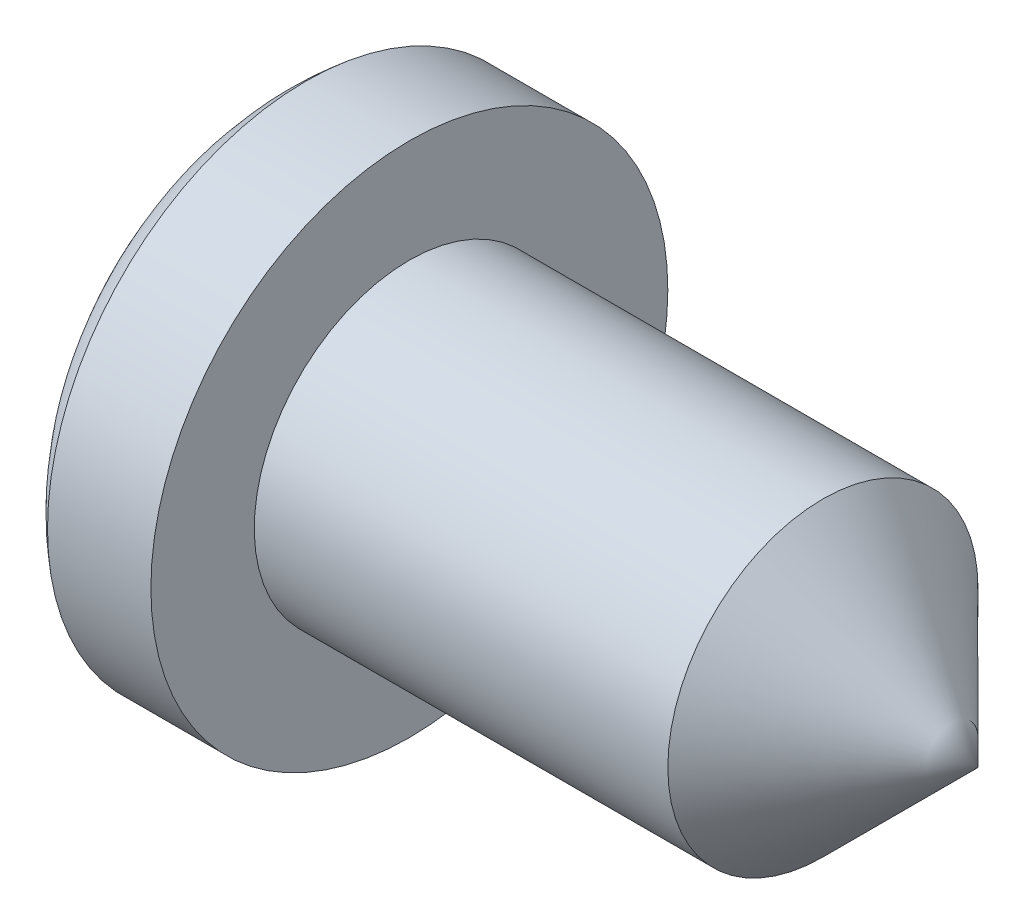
ISO-10303-21;
HEADER;
FILE_DESCRIPTION(('STEP AP214'),'2;1');
FILE_NAME('part.step','',(''),(''),'','','');
FILE_SCHEMA(('AUTOMOTIVE_DESIGN { 1 0 10303 214 1 1 1 1 }'));
ENDSEC;
DATA;
#1=APPLICATION_CONTEXT('core data for automotive mechanical design processes');
#2=APPLICATION_PROTOCOL_DEFINITION('international standard','automotive_design',2000,#1);
#3=PRODUCT_CONTEXT('',#1,'mechanical');
#4=PRODUCT('Part','Part','',(#3));
#5=PRODUCT_RELATED_PRODUCT_CATEGORY('part','',(#4));
#6=PRODUCT_DEFINITION_FORMATION('','',#4);
#7=PRODUCT_DEFINITION_CONTEXT('part definition',#1,'design');
#8=PRODUCT_DEFINITION('design','',#6,#7);
#9=PRODUCT_DEFINITION_SHAPE('','',#8);
#10=(LENGTH_UNIT() NAMED_UNIT(*) SI_UNIT(.MILLI.,.METRE.));
#11=(NAMED_UNIT(*) PLANE_ANGLE_UNIT() SI_UNIT($,.RADIAN.));
#12=(NAMED_UNIT(*) SI_UNIT($,.STERADIAN.) SOLID_ANGLE_UNIT());
#13=UNCERTAINTY_MEASURE_WITH_UNIT(LENGTH_MEASURE(1.E-05),#10,'distance_accuracy_value','');
#14=(GEOMETRIC_REPRESENTATION_CONTEXT(3) GLOBAL_UNCERTAINTY_ASSIGNED_CONTEXT((#13)) GLOBAL_UNIT_ASSIGNED_CONTEXT((#10,
#11,#12)) REPRESENTATION_CONTEXT('',''));
#15=CARTESIAN_POINT('',(0.,0.,0.));
#16=DIRECTION('',(0.,0.,1.));
#17=DIRECTION('',(1.,0.,0.));
#18=AXIS2_PLACEMENT_3D('',#15,#16,#17);
#19=CARTESIAN_POINT('',(14.3246310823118,28.0332089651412,-0.2));
#20=DIRECTION('',(0.707106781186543,0.707106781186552,0.));
#21=DIRECTION('',(-0.707106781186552,0.707106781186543,0.));
#22=AXIS2_PLACEMENT_3D('',#19,#20,#21);
#23=PLANE('',#22);
#24=DIRECTION('',(0.,0.,-1.));
#25=VECTOR('',#24,1.);
#26=CARTESIAN_POINT('',(16.191790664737,26.166049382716,-0.199999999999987));
#27=LINE('',#26,#25);
#28=CARTESIAN_POINT('',(16.191790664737,26.166049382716,0.2));
#29=VERTEX_POINT('',#28);
#30=CARTESIAN_POINT('',(16.191790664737,26.166049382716,-0.2));
#31=VERTEX_POINT('',#30);
#32=EDGE_CURVE('E384',#29,#31,#27,.T.);
#33=ORIENTED_EDGE('',*,*,#32,.F.);
#34=DIRECTION('',(-0.707106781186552,0.707106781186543,0.));
#35=VECTOR('',#34,1.);
#36=CARTESIAN_POINT('',(14.3246310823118,28.0332089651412,0.2));
#37=LINE('',#36,#35);
#38=CARTESIAN_POINT('',(15.2194540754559,27.1383859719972,0.2));
#39=VERTEX_POINT('',#38);
#40=EDGE_CURVE('E238',#29,#39,#37,.T.);
#41=ORIENTED_EDGE('',*,*,#40,.T.);
#42=CARTESIAN_POINT('',(15.2194577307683,27.1383823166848,-0.2002));
#43=CARTESIAN_POINT('',(15.2182655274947,27.1395745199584,-0.133466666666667));
#44=CARTESIAN_POINT('',(15.2176694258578,27.1401706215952,-0.0667333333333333));
#45=CARTESIAN_POINT('',(15.2176694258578,27.1401706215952,0.0667333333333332));
#46=CARTESIAN_POINT('',(15.2182655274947,27.1395745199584,0.133466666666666));
#47=CARTESIAN_POINT('',(15.2194577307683,27.1383823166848,0.2002));
#48=B_SPLINE_CURVE_WITH_KNOTS('',3,(#42,#43,#44,#45,#46,#47),.UNSPECIFIED.,.F.,.F.,(4,2,4),(0.,
0.200215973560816,0.400431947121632),.UNSPECIFIED.);
#49=CARTESIAN_POINT('',(15.2194540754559,27.1383859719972,-0.2));
#50=VERTEX_POINT('',#49);
#51=EDGE_CURVE('E225',#50,#39,#48,.T.);
#52=ORIENTED_EDGE('',*,*,#51,.F.);
#53=DIRECTION('',(-0.707106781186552,0.707106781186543,0.));
#54=VECTOR('',#53,1.);
#55=CARTESIAN_POINT('',(14.3246310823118,28.0332089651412,-0.2));
#56=LINE('',#55,#54);
#57=EDGE_CURVE('E344',#31,#50,#56,.T.);
#58=ORIENTED_EDGE('',*,*,#57,.F.);
#59=EDGE_LOOP('',(#33,#41,#52,#58));
#60=FACE_BOUND('',#59,.T.);
#61=ADVANCED_FACE('F32',(#60),#23,.F.);
#62=CARTESIAN_POINT('',(14.3246310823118,28.0332089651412,-0.2));
#63=DIRECTION('',(0.,0.,-1.));
#64=DIRECTION('',(-1.,0.,0.));
#65=AXIS2_PLACEMENT_3D('',#62,#63,#64);
#66=PLANE('',#65);
#67=DIRECTION('',(0.707106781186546,0.707106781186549,0.));
#68=VECTOR('',#67,1.);
#69=CARTESIAN_POINT('',(16.2436425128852,25.8179012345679,-0.2));
#70=LINE('',#69,#68);
#71=CARTESIAN_POINT('',(15.2194540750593,24.793712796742,-0.2));
#72=VERTEX_POINT('',#71);
#73=CARTESIAN_POINT('',(16.191790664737,25.766049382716,-0.2));
#74=VERTEX_POINT('',#73);
#75=EDGE_CURVE('E360',#72,#74,#70,.T.);
#76=ORIENTED_EDGE('',*,*,#75,.T.);
#77=DIRECTION('',(-1.,0.,0.));
#78=VECTOR('',#77,1.);
#79=CARTESIAN_POINT('',(14.3246310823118,25.766049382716,-0.2));
#80=LINE('',#79,#78);
#81=CARTESIAN_POINT('',(15.3185848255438,25.766049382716,-0.2));
#82=VERTEX_POINT('',#81);
#83=EDGE_CURVE('E364',#74,#82,#80,.T.);
#84=ORIENTED_EDGE('',*,*,#83,.T.);
#85=CARTESIAN_POINT('',(15.3498665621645,25.9660493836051,-0.2));
#86=CARTESIAN_POINT('',(15.349866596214,25.9824379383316,-0.2));
#87=CARTESIAN_POINT('',(15.3490354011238,25.9988264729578,-0.2));
#88=CARTESIAN_POINT('',(15.3459296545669,26.0314936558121,-0.2));
#89=CARTESIAN_POINT('',(15.3436517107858,26.0477719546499,-0.2));
#90=CARTESIAN_POINT('',(15.3380758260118,26.0803864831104,-0.2));
#91=CARTESIAN_POINT('',(15.3347635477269,26.0967201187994,-0.2));
#92=CARTESIAN_POINT('',(15.3275698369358,26.1292504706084,-0.2));
#93=CARTESIAN_POINT('',(15.323688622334,26.1454472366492,-0.2));
#94=CARTESIAN_POINT('',(15.3117437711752,26.1937063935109,-0.2));
#95=CARTESIAN_POINT('',(15.3033267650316,26.2256788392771,-0.2));
#96=CARTESIAN_POINT('',(15.2868788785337,26.2897239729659,-0.2));
#97=CARTESIAN_POINT('',(15.2788479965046,26.321796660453,-0.2));
#98=CARTESIAN_POINT('',(15.2637226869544,26.3861471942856,-0.2));
#99=CARTESIAN_POINT('',(15.2566277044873,26.4184249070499,-0.2));
#100=CARTESIAN_POINT('',(15.2436509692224,26.4832247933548,-0.2));
#101=CARTESIAN_POINT('',(15.2377692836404,26.5157469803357,-0.2));
#102=CARTESIAN_POINT('',(15.2223044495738,26.6129073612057,-0.2));
#103=CARTESIAN_POINT('',(15.2147188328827,26.6778810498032,-0.2));
#104=CARTESIAN_POINT('',(15.2055015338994,26.8083215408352,-0.2));
#105=CARTESIAN_POINT('',(15.2038761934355,26.8737887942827,-0.2));
#106=CARTESIAN_POINT('',(15.2068341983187,27.0058258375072,-0.2));
#107=CARTESIAN_POINT('',(15.2115352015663,27.0723931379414,-0.2));
#108=CARTESIAN_POINT('',(15.2274147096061,27.2047269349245,-0.2));
#109=CARTESIAN_POINT('',(15.2385909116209,27.2704937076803,-0.2));
#110=CARTESIAN_POINT('',(15.2674828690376,27.4011208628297,-0.2));
#111=CARTESIAN_POINT('',(15.2852490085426,27.4659701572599,-0.2));
#112=CARTESIAN_POINT('',(15.3271596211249,27.5935807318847,-0.2));
#113=CARTESIAN_POINT('',(15.3513063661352,27.6563412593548,-0.2));
#114=CARTESIAN_POINT('',(15.4249749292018,27.8223967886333,-0.2));
#115=CARTESIAN_POINT('',(15.4803975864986,27.9231468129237,-0.2));
#116=CARTESIAN_POINT('',(15.6074012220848,28.1133509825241,-0.2));
#117=CARTESIAN_POINT('',(15.6789291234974,28.202840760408,-0.2));
#118=CARTESIAN_POINT('',(15.83513921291,28.367222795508,-0.2));
#119=CARTESIAN_POINT('',(15.9196324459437,28.4422944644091,-0.2));
#120=CARTESIAN_POINT('',(16.1001293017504,28.5772009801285,-0.2));
#121=CARTESIAN_POINT('',(16.1961428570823,28.6370225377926,-0.2));
#122=CARTESIAN_POINT('',(16.3965516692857,28.7394574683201,-0.2));
#123=CARTESIAN_POINT('',(16.5009185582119,28.7821263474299,-0.2));
#124=CARTESIAN_POINT('',(16.7153142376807,28.8493070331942,-0.2));
#125=CARTESIAN_POINT('',(16.8253416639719,28.8738231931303,-0.2));
#126=CARTESIAN_POINT('',(17.0478497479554,28.9040007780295,-0.2));
#127=CARTESIAN_POINT('',(17.1603280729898,28.9096794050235,-0.2));
#128=CARTESIAN_POINT('',(17.3846493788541,28.9020680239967,-0.2));
#129=CARTESIAN_POINT('',(17.4964923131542,28.8887766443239,-0.2));
#130=CARTESIAN_POINT('',(17.7163319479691,28.8436073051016,-0.2));
#131=CARTESIAN_POINT('',(17.8243295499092,28.8117337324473,-0.2));
#132=CARTESIAN_POINT('',(18.0334343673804,28.7303155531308,-0.2));
#133=CARTESIAN_POINT('',(18.13454212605,28.6807723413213,-0.2));
#134=CARTESIAN_POINT('',(18.3270391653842,28.5654109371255,-0.2));
#135=CARTESIAN_POINT('',(18.4184258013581,28.4995883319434,-0.2));
#136=CARTESIAN_POINT('',(18.588879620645,28.3535400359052,-0.2));
#137=CARTESIAN_POINT('',(18.667944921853,28.2733121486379,-0.2));
#138=CARTESIAN_POINT('',(18.8115966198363,28.100652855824,-0.2));
#139=CARTESIAN_POINT('',(18.8761670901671,28.0082082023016,-0.2));
#140=CARTESIAN_POINT('',(18.9889175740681,27.8138240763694,-0.2));
#141=CARTESIAN_POINT('',(19.0370992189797,27.7118855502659,-0.2));
#142=CARTESIAN_POINT('',(19.1159538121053,27.5010019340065,-0.2));
#143=CARTESIAN_POINT('',(19.1465556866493,27.3920303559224,-0.2));
#144=CARTESIAN_POINT('',(19.189195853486,27.1706244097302,-0.2));
#145=CARTESIAN_POINT('',(19.2012611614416,27.0581953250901,-0.2));
#146=CARTESIAN_POINT('',(19.2051841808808,26.9049123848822,-0.2));
#147=CARTESIAN_POINT('',(19.2050216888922,26.8641341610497,-0.2));
#148=CARTESIAN_POINT('',(19.2023430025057,26.7826280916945,-0.2));
#149=CARTESIAN_POINT('',(19.1998257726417,26.741900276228,-0.2));
#150=CARTESIAN_POINT('',(19.192485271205,26.6603801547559,-0.2));
#151=CARTESIAN_POINT('',(19.1876465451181,26.6195892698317,-0.2));
#152=CARTESIAN_POINT('',(19.1758157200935,26.5384018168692,-0.2));
#153=CARTESIAN_POINT('',(19.1688276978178,26.4980046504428,-0.2));
#154=CARTESIAN_POINT('',(19.1521698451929,26.4136838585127,-0.2));
#155=CARTESIAN_POINT('',(19.1423053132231,26.3697992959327,-0.2));
#156=CARTESIAN_POINT('',(19.1263441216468,26.3041191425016,-0.2));
#157=CARTESIAN_POINT('',(19.1208103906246,26.2821814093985,-0.2));
#158=CARTESIAN_POINT('',(19.1095736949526,26.2383472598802,-0.2));
#159=CARTESIAN_POINT('',(19.1038707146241,26.216450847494,-0.2));
#160=CARTESIAN_POINT('',(19.0927849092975,26.1731454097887,-0.2));
#161=CARTESIAN_POINT('',(19.0873976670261,26.1517375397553,-0.2));
#162=CARTESIAN_POINT('',(19.0773813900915,26.1087297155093,-0.2));
#163=CARTESIAN_POINT('',(19.0727525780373,26.0871297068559,-0.2));
#164=CARTESIAN_POINT('',(19.0652849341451,26.0438745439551,-0.2));
#165=CARTESIAN_POINT('',(19.0624239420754,26.0222236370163,-0.2));
#166=CARTESIAN_POINT('',(19.0594858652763,25.9787525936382,-0.2));
#167=CARTESIAN_POINT('',(19.0594027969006,25.9569329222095,-0.2));
#168=CARTESIAN_POINT('',(19.0618864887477,25.9160405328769,-0.2));
#169=CARTESIAN_POINT('',(19.0641432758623,25.8969460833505,-0.2));
#170=CARTESIAN_POINT('',(19.0701328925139,25.8589680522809,-0.2));
#171=CARTESIAN_POINT('',(19.0738689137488,25.8400850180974,-0.2));
#172=CARTESIAN_POINT('',(19.0821658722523,25.8022599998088,-0.2));
#173=CARTESIAN_POINT('',(19.0867366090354,25.7833202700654,-0.2));
#174=CARTESIAN_POINT('',(19.0961782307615,25.7455355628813,-0.2));
#175=CARTESIAN_POINT('',(19.1010488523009,25.7266905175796,-0.2));
#176=CARTESIAN_POINT('',(19.1159006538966,25.6691460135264,-0.2));
#177=CARTESIAN_POINT('',(19.1258615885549,25.6304395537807,-0.2));
#178=CARTESIAN_POINT('',(19.1444222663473,25.5528937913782,-0.2));
#179=CARTESIAN_POINT('',(19.153028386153,25.5140560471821,-0.2));
#180=CARTESIAN_POINT('',(19.1729355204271,25.4133209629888,-0.2));
#181=CARTESIAN_POINT('',(19.1828936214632,25.3511468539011,-0.2));
#182=CARTESIAN_POINT('',(19.1974961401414,25.2260677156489,-0.2));
#183=CARTESIAN_POINT('',(19.2021321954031,25.1631616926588,-0.2));
#184=CARTESIAN_POINT('',(19.2057528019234,25.0374075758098,-0.2));
#185=CARTESIAN_POINT('',(19.2047575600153,24.9745600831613,-0.2));
#186=CARTESIAN_POINT('',(19.1970358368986,24.8492342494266,-0.2));
#187=CARTESIAN_POINT('',(19.1903110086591,24.7867558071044,-0.2));
#188=CARTESIAN_POINT('',(19.1713719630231,24.6643236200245,-0.2));
#189=CARTESIAN_POINT('',(19.1593076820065,24.6043468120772,-0.2));
#190=CARTESIAN_POINT('',(19.1298109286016,24.4857452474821,-0.2));
#191=CARTESIAN_POINT('',(19.1123782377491,24.4271205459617,-0.2));
#192=CARTESIAN_POINT('',(19.0522278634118,24.2541672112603,-0.2));
#193=CARTESIAN_POINT('',(19.0016118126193,24.1424621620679,-0.2));
#194=CARTESIAN_POINT('',(18.8852536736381,23.9377123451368,-0.2));
#195=CARTESIAN_POINT('',(18.8208345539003,23.8439065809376,-0.2));
#196=CARTESIAN_POINT('',(18.6769957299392,23.6684703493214,-0.2));
#197=CARTESIAN_POINT('',(18.5975672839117,23.5868470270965,-0.2));
#198=CARTESIAN_POINT('',(18.4267245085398,23.4388592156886,-0.2));
#199=CARTESIAN_POINT('',(18.3354127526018,23.3723761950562,-0.2));
#200=CARTESIAN_POINT('',(18.1429302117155,23.2557392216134,-0.2));
#201=CARTESIAN_POINT('',(18.0417623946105,23.2055803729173,-0.2));
#202=CARTESIAN_POINT('',(17.832640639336,23.1230894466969,-0.2));
#203=CARTESIAN_POINT('',(17.7247008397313,23.090721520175,-0.2));
#204=CARTESIAN_POINT('',(17.5049075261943,23.0445780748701,-0.2));
#205=CARTESIAN_POINT('',(17.3930536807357,23.0308041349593,-0.2));
#206=CARTESIAN_POINT('',(17.1687083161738,23.0222508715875,-0.2));
#207=CARTESIAN_POINT('',(17.056217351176,23.0274570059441,-0.2));
#208=CARTESIAN_POINT('',(16.8337067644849,23.0566827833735,-0.2));
#209=CARTESIAN_POINT('',(16.7236871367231,23.0807023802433,-0.2));
#210=CARTESIAN_POINT('',(16.5092465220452,23.1468685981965,-0.2));
#211=CARTESIAN_POINT('',(16.4048252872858,23.1890144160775,-0.2));
#212=CARTESIAN_POINT('',(16.2045438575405,23.2902274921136,-0.2));
#213=CARTESIAN_POINT('',(16.1086830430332,23.3492935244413,-0.2));
#214=CARTESIAN_POINT('',(15.9281852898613,23.482694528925,-0.2));
#215=CARTESIAN_POINT('',(15.8435533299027,23.5570362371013,-0.2));
#216=CARTESIAN_POINT('',(15.6879361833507,23.7188665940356,-0.2));
#217=CARTESIAN_POINT('',(15.6169532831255,23.8063574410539,-0.2));
#218=CARTESIAN_POINT('',(15.4905419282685,23.992120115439,-0.2));
#219=CARTESIAN_POINT('',(15.4351363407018,24.0904075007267,-0.2));
#220=CARTESIAN_POINT('',(15.3415398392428,24.294850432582,-0.2));
#221=CARTESIAN_POINT('',(15.3033476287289,24.4010053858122,-0.2));
#222=CARTESIAN_POINT('',(15.2449701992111,24.6187740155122,-0.2));
#223=CARTESIAN_POINT('',(15.2248860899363,24.730414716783,-0.2));
#224=CARTESIAN_POINT('',(15.203440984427,24.9552684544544,-0.2));
#225=CARTESIAN_POINT('',(15.2020432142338,25.0684779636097,-0.2));
#226=CARTESIAN_POINT('',(15.2139721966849,25.2470333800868,-0.2));
#227=CARTESIAN_POINT('',(15.2214559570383,25.3128363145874,-0.2));
#228=CARTESIAN_POINT('',(15.2368613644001,25.4111034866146,-0.2));
#229=CARTESIAN_POINT('',(15.2427211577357,25.4439007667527,-0.2));
#230=CARTESIAN_POINT('',(15.2556786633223,25.5092186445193,-0.2));
#231=CARTESIAN_POINT('',(15.2627752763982,25.5417394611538,-0.2));
#232=CARTESIAN_POINT('',(15.2780382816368,25.6070200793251,-0.2));
#233=CARTESIAN_POINT('',(15.2862186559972,25.63977653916,-0.2));
#234=CARTESIAN_POINT('',(15.3030293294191,25.7052840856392,-0.2));
#235=CARTESIAN_POINT('',(15.3116609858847,25.7380348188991,-0.2));
#236=CARTESIAN_POINT('',(15.3237656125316,25.7869734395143,-0.2));
#237=CARTESIAN_POINT('',(15.3276189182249,25.8030645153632,-0.2));
#238=CARTESIAN_POINT('',(15.3347623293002,25.8353789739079,-0.2));
#239=CARTESIAN_POINT('',(15.338052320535,25.8516023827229,-0.2));
#240=CARTESIAN_POINT('',(15.3436227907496,25.8841308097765,-0.2));
#241=CARTESIAN_POINT('',(15.3459092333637,25.9004347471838,-0.2));
#242=CARTESIAN_POINT('',(15.3490303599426,25.9331756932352,-0.2));
#243=CARTESIAN_POINT('',(15.3498665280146,25.9496125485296,-0.2));
#244=CARTESIAN_POINT('',(15.3498665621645,25.9660493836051,-0.2));
#245=B_SPLINE_CURVE_WITH_KNOTS('',3,(#85,#86,#87,#88,#89,#90,#91,#92,#93,#94,#95,#96,#97,#98,
#99,#100,#101,#102,#103,#104,#105,#106,#107,#108,#109,#110,#111,#112,#113,#114,#115,#116,#117,
#118,#119,#120,#121,#122,#123,#124,#125,#126,#127,#128,#129,#130,#131,#132,#133,#134,#135,#136,
#137,#138,#139,#140,#141,#142,#143,#144,#145,#146,#147,#148,#149,#150,#151,#152,#153,#154,#155,
#156,#157,#158,#159,#160,#161,#162,#163,#164,#165,#166,#167,#168,#169,#170,#171,#172,#173,#174,
#175,#176,#177,#178,#179,#180,#181,#182,#183,#184,#185,#186,#187,#188,#189,#190,#191,#192,#193,
#194,#195,#196,#197,#198,#199,#200,#201,#202,#203,#204,#205,#206,#207,#208,#209,#210,#211,#212,
#213,#214,#215,#216,#217,#218,#219,#220,#221,#222,#223,#224,#225,#226,#227,#228,#229,#230,#231,
#232,#233,#234,#235,#236,#237,#238,#239,#240,#241,#242,#243,#244),.UNSPECIFIED.,.T.,.F.,(4,2,2,
2,2,2,2,2,2,2,2,2,2,2,2,2,2,2,2,2,2,2,2,2,2,2,2,2,2,2,2,2,2,2,2,2,2,2,2,2,2,2,2,2,2,2,2,2,2,2,2,
2,2,2,2,2,2,2,2,2,2,2,2,2,2,2,2,2,2,2,2,2,2,2,2,2,2,2,2,4),(0.,0.0491492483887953,
0.0984141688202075,0.148394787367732,0.198356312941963,0.297539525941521,0.396722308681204,
0.495846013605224,0.594975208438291,0.790948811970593,0.987130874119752,1.18701242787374,
1.38682294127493,1.58819372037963,1.78963629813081,2.13279384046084,2.47483660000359,
2.81229952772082,3.15005552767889,3.48670957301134,3.82328285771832,4.15954870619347,
4.49583887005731,4.83204967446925,5.16823394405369,5.50450944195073,5.84083625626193,
6.17753082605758,6.51419187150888,6.85220460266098,7.18972423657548,7.31201418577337,
7.43435793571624,7.55752769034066,7.68046524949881,7.81535713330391,7.88323159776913,
7.95111236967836,8.01733553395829,8.08357810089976,8.14897249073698,8.21422601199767,
8.27181807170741,8.32953507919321,8.3879792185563,8.44637273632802,8.56626681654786,
8.68557853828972,8.87426842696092,9.06325439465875,9.2515626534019,9.43981660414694,
9.62309003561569,9.80637092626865,10.1720435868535,10.5118541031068,10.8518631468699,
11.1891110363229,11.526257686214,11.8627224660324,12.1992158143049,12.535451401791,
12.8716861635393,13.2079060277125,13.5441015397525,13.8804456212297,14.2168459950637,
14.5537376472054,14.89060391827,15.2293396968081,15.5674087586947,15.7658507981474,
15.8657763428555,15.9656135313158,16.0668940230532,16.1684989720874,16.2181326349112,
16.2677763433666,16.3171209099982,16.3664149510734),.UNSPECIFIED.);
#246=EDGE_CURVE('E219',#72,#82,#245,.T.);
#247=ORIENTED_EDGE('',*,*,#246,.F.);
#248=EDGE_LOOP('',(#76,#84,#247));
#249=FACE_BOUND('',#248,.T.);
#250=ADVANCED_FACE('F213',(#249),#66,.F.);
#251=DIRECTION('',(-1.,0.,0.));
#252=VECTOR('',#251,1.);
#253=CARTESIAN_POINT('',(14.3246310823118,26.166049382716,-0.2));
#254=LINE('',#253,#252);
#255=CARTESIAN_POINT('',(15.3185848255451,26.166049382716,-0.2));
#256=VERTEX_POINT('',#255);
#257=EDGE_CURVE('E383',#31,#256,#254,.T.);
#258=ORIENTED_EDGE('',*,*,#257,.F.);
#259=ORIENTED_EDGE('',*,*,#57,.T.);
#260=EDGE_CURVE('E224',#256,#50,#245,.T.);
#261=ORIENTED_EDGE('',*,*,#260,.F.);
#262=EDGE_LOOP('',(#258,#259,#261));
#263=FACE_BOUND('',#262,.T.);
#264=ADVANCED_FACE('F214',(#263),#66,.F.);
#265=CARTESIAN_POINT('',(14.3246310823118,28.0332089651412,0.2));
#266=DIRECTION('',(0.,0.,-1.));
#267=DIRECTION('',(-1.,0.,0.));
#268=AXIS2_PLACEMENT_3D('',#265,#266,#267);
#269=PLANE('',#268);
#270=DIRECTION('',(-1.,0.,0.));
#271=VECTOR('',#270,1.);
#272=CARTESIAN_POINT('',(14.3246310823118,25.766049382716,0.2));
#273=LINE('',#272,#271);
#274=CARTESIAN_POINT('',(16.1917906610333,25.766049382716,0.2));
#275=VERTEX_POINT('',#274);
#276=CARTESIAN_POINT('',(15.3185848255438,25.766049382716,0.2));
#277=VERTEX_POINT('',#276);
#278=EDGE_CURVE('E11',#275,#277,#273,.T.);
#279=ORIENTED_EDGE('',*,*,#278,.F.);
#280=DIRECTION('',(0.707106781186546,0.707106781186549,0.));
#281=VECTOR('',#280,1.);
#282=CARTESIAN_POINT('',(16.2436425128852,25.8179012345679,0.2));
#283=LINE('',#282,#281);
#284=CARTESIAN_POINT('',(15.2194540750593,24.793712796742,0.2));
#285=VERTEX_POINT('',#284);
#286=EDGE_CURVE('E352',#285,#275,#283,.T.);
#287=ORIENTED_EDGE('',*,*,#286,.F.);
#288=CARTESIAN_POINT('',(15.3498665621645,25.9660493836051,0.2));
#289=CARTESIAN_POINT('',(15.349866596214,25.9824379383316,0.2));
#290=CARTESIAN_POINT('',(15.3490354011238,25.9988264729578,0.2));
#291=CARTESIAN_POINT('',(15.3459296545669,26.0314936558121,0.2));
#292=CARTESIAN_POINT('',(15.3436517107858,26.0477719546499,0.2));
#293=CARTESIAN_POINT('',(15.3380758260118,26.0803864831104,0.2));
#294=CARTESIAN_POINT('',(15.3347635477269,26.0967201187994,0.2));
#295=CARTESIAN_POINT('',(15.3275698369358,26.1292504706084,0.2));
#296=CARTESIAN_POINT('',(15.323688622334,26.1454472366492,0.2));
#297=CARTESIAN_POINT('',(15.3117437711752,26.1937063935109,0.2));
#298=CARTESIAN_POINT('',(15.3033267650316,26.2256788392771,0.2));
#299=CARTESIAN_POINT('',(15.2868788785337,26.2897239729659,0.2));
#300=CARTESIAN_POINT('',(15.2788479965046,26.321796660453,0.2));
#301=CARTESIAN_POINT('',(15.2637226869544,26.3861471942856,0.2));
#302=CARTESIAN_POINT('',(15.2566277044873,26.4184249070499,0.2));
#303=CARTESIAN_POINT('',(15.2436509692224,26.4832247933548,0.2));
#304=CARTESIAN_POINT('',(15.2377692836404,26.5157469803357,0.2));
#305=CARTESIAN_POINT('',(15.2223044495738,26.6129073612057,0.2));
#306=CARTESIAN_POINT('',(15.2147188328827,26.6778810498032,0.2));
#307=CARTESIAN_POINT('',(15.2055015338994,26.8083215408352,0.2));
#308=CARTESIAN_POINT('',(15.2038761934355,26.8737887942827,0.2));
#309=CARTESIAN_POINT('',(15.2068341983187,27.0058258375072,0.2));
#310=CARTESIAN_POINT('',(15.2115352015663,27.0723931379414,0.2));
#311=CARTESIAN_POINT('',(15.2274147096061,27.2047269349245,0.2));
#312=CARTESIAN_POINT('',(15.2385909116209,27.2704937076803,0.2));
#313=CARTESIAN_POINT('',(15.2674828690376,27.4011208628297,0.2));
#314=CARTESIAN_POINT('',(15.2852490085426,27.4659701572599,0.2));
#315=CARTESIAN_POINT('',(15.3271596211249,27.5935807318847,0.2));
#316=CARTESIAN_POINT('',(15.3513063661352,27.6563412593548,0.2));
#317=CARTESIAN_POINT('',(15.4249749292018,27.8223967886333,0.2));
#318=CARTESIAN_POINT('',(15.4803975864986,27.9231468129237,0.2));
#319=CARTESIAN_POINT('',(15.6074012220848,28.1133509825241,0.2));
#320=CARTESIAN_POINT('',(15.6789291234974,28.202840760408,0.2));
#321=CARTESIAN_POINT('',(15.83513921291,28.367222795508,0.2));
#322=CARTESIAN_POINT('',(15.9196324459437,28.4422944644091,0.2));
#323=CARTESIAN_POINT('',(16.1001293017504,28.5772009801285,0.2));
#324=CARTESIAN_POINT('',(16.1961428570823,28.6370225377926,0.2));
#325=CARTESIAN_POINT('',(16.3965516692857,28.7394574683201,0.2));
#326=CARTESIAN_POINT('',(16.5009185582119,28.7821263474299,0.2));
#327=CARTESIAN_POINT('',(16.7153142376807,28.8493070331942,0.2));
#328=CARTESIAN_POINT('',(16.8253416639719,28.8738231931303,0.2));
#329=CARTESIAN_POINT('',(17.0478497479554,28.9040007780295,0.2));
#330=CARTESIAN_POINT('',(17.1603280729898,28.9096794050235,0.2));
#331=CARTESIAN_POINT('',(17.3846493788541,28.9020680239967,0.2));
#332=CARTESIAN_POINT('',(17.4964923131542,28.8887766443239,0.2));
#333=CARTESIAN_POINT('',(17.7163319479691,28.8436073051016,0.2));
#334=CARTESIAN_POINT('',(17.8243295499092,28.8117337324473,0.2));
#335=CARTESIAN_POINT('',(18.0334343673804,28.7303155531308,0.2));
#336=CARTESIAN_POINT('',(18.13454212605,28.6807723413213,0.2));
#337=CARTESIAN_POINT('',(18.3270391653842,28.5654109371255,0.2));
#338=CARTESIAN_POINT('',(18.4184258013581,28.4995883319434,0.2));
#339=CARTESIAN_POINT('',(18.588879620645,28.3535400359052,0.2));
#340=CARTESIAN_POINT('',(18.667944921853,28.2733121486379,0.2));
#341=CARTESIAN_POINT('',(18.8115966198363,28.100652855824,0.2));
#342=CARTESIAN_POINT('',(18.8761670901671,28.0082082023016,0.2));
#343=CARTESIAN_POINT('',(18.9889175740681,27.8138240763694,0.2));
#344=CARTESIAN_POINT('',(19.0370992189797,27.7118855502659,0.2));
#345=CARTESIAN_POINT('',(19.1159538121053,27.5010019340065,0.2));
#346=CARTESIAN_POINT('',(19.1465556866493,27.3920303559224,0.2));
#347=CARTESIAN_POINT('',(19.189195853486,27.1706244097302,0.2));
#348=CARTESIAN_POINT('',(19.2012611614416,27.0581953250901,0.2));
#349=CARTESIAN_POINT('',(19.2051841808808,26.9049123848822,0.2));
#350=CARTESIAN_POINT('',(19.2050216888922,26.8641341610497,0.2));
#351=CARTESIAN_POINT('',(19.2023430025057,26.7826280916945,0.2));
#352=CARTESIAN_POINT('',(19.1998257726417,26.741900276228,0.2));
#353=CARTESIAN_POINT('',(19.192485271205,26.6603801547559,0.2));
#354=CARTESIAN_POINT('',(19.1876465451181,26.6195892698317,0.2));
#355=CARTESIAN_POINT('',(19.1758157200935,26.5384018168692,0.2));
#356=CARTESIAN_POINT('',(19.1688276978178,26.4980046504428,0.2));
#357=CARTESIAN_POINT('',(19.1521698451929,26.4136838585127,0.2));
#358=CARTESIAN_POINT('',(19.1423053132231,26.3697992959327,0.2));
#359=CARTESIAN_POINT('',(19.1263441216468,26.3041191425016,0.2));
#360=CARTESIAN_POINT('',(19.1208103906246,26.2821814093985,0.2));
#361=CARTESIAN_POINT('',(19.1095736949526,26.2383472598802,0.2));
#362=CARTESIAN_POINT('',(19.1038707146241,26.216450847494,0.2));
#363=CARTESIAN_POINT('',(19.0927849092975,26.1731454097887,0.2));
#364=CARTESIAN_POINT('',(19.0873976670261,26.1517375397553,0.2));
#365=CARTESIAN_POINT('',(19.0773813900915,26.1087297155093,0.2));
#366=CARTESIAN_POINT('',(19.0727525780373,26.0871297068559,0.2));
#367=CARTESIAN_POINT('',(19.0652849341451,26.0438745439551,0.2));
#368=CARTESIAN_POINT('',(19.0624239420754,26.0222236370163,0.2));
#369=CARTESIAN_POINT('',(19.0594858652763,25.9787525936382,0.2));
#370=CARTESIAN_POINT('',(19.0594027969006,25.9569329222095,0.2));
#371=CARTESIAN_POINT('',(19.0618864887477,25.9160405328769,0.2));
#372=CARTESIAN_POINT('',(19.0641432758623,25.8969460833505,0.2));
#373=CARTESIAN_POINT('',(19.0701328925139,25.8589680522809,0.2));
#374=CARTESIAN_POINT('',(19.0738689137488,25.8400850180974,0.2));
#375=CARTESIAN_POINT('',(19.0821658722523,25.8022599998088,0.2));
#376=CARTESIAN_POINT('',(19.0867366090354,25.7833202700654,0.2));
#377=CARTESIAN_POINT('',(19.0961782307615,25.7455355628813,0.2));
#378=CARTESIAN_POINT('',(19.1010488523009,25.7266905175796,0.2));
#379=CARTESIAN_POINT('',(19.1159006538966,25.6691460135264,0.2));
#380=CARTESIAN_POINT('',(19.1258615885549,25.6304395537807,0.2));
#381=CARTESIAN_POINT('',(19.1444222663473,25.5528937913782,0.2));
#382=CARTESIAN_POINT('',(19.153028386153,25.5140560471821,0.2));
#383=CARTESIAN_POINT('',(19.1729355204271,25.4133209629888,0.2));
#384=CARTESIAN_POINT('',(19.1828936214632,25.3511468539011,0.2));
#385=CARTESIAN_POINT('',(19.1974961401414,25.2260677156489,0.2));
#386=CARTESIAN_POINT('',(19.2021321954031,25.1631616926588,0.2));
#387=CARTESIAN_POINT('',(19.2057528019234,25.0374075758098,0.2));
#388=CARTESIAN_POINT('',(19.2047575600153,24.9745600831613,0.2));
#389=CARTESIAN_POINT('',(19.1970358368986,24.8492342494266,0.2));
#390=CARTESIAN_POINT('',(19.1903110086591,24.7867558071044,0.2));
#391=CARTESIAN_POINT('',(19.1713719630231,24.6643236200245,0.2));
#392=CARTESIAN_POINT('',(19.1593076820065,24.6043468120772,0.2));
#393=CARTESIAN_POINT('',(19.1298109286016,24.4857452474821,0.2));
#394=CARTESIAN_POINT('',(19.1123782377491,24.4271205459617,0.2));
#395=CARTESIAN_POINT('',(19.0522278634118,24.2541672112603,0.2));
#396=CARTESIAN_POINT('',(19.0016118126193,24.1424621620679,0.2));
#397=CARTESIAN_POINT('',(18.8852536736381,23.9377123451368,0.2));
#398=CARTESIAN_POINT('',(18.8208345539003,23.8439065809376,0.2));
#399=CARTESIAN_POINT('',(18.6769957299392,23.6684703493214,0.2));
#400=CARTESIAN_POINT('',(18.5975672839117,23.5868470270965,0.2));
#401=CARTESIAN_POINT('',(18.4267245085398,23.4388592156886,0.2));
#402=CARTESIAN_POINT('',(18.3354127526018,23.3723761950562,0.2));
#403=CARTESIAN_POINT('',(18.1429302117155,23.2557392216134,0.2));
#404=CARTESIAN_POINT('',(18.0417623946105,23.2055803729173,0.2));
#405=CARTESIAN_POINT('',(17.832640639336,23.1230894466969,0.2));
#406=CARTESIAN_POINT('',(17.7247008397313,23.090721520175,0.2));
#407=CARTESIAN_POINT('',(17.5049075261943,23.0445780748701,0.2));
#408=CARTESIAN_POINT('',(17.3930536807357,23.0308041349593,0.2));
#409=CARTESIAN_POINT('',(17.1687083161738,23.0222508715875,0.2));
#410=CARTESIAN_POINT('',(17.056217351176,23.0274570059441,0.2));
#411=CARTESIAN_POINT('',(16.8337067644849,23.0566827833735,0.2));
#412=CARTESIAN_POINT('',(16.7236871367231,23.0807023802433,0.2));
#413=CARTESIAN_POINT('',(16.5092465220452,23.1468685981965,0.2));
#414=CARTESIAN_POINT('',(16.4048252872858,23.1890144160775,0.2));
#415=CARTESIAN_POINT('',(16.2045438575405,23.2902274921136,0.2));
#416=CARTESIAN_POINT('',(16.1086830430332,23.3492935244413,0.2));
#417=CARTESIAN_POINT('',(15.9281852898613,23.482694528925,0.2));
#418=CARTESIAN_POINT('',(15.8435533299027,23.5570362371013,0.2));
#419=CARTESIAN_POINT('',(15.6879361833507,23.7188665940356,0.2));
#420=CARTESIAN_POINT('',(15.6169532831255,23.8063574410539,0.2));
#421=CARTESIAN_POINT('',(15.4905419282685,23.992120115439,0.2));
#422=CARTESIAN_POINT('',(15.4351363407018,24.0904075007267,0.2));
#423=CARTESIAN_POINT('',(15.3415398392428,24.294850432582,0.2));
#424=CARTESIAN_POINT('',(15.3033476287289,24.4010053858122,0.2));
#425=CARTESIAN_POINT('',(15.2449701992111,24.6187740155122,0.2));
#426=CARTESIAN_POINT('',(15.2248860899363,24.730414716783,0.2));
#427=CARTESIAN_POINT('',(15.203440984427,24.9552684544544,0.2));
#428=CARTESIAN_POINT('',(15.2020432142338,25.0684779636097,0.2));
#429=CARTESIAN_POINT('',(15.2139721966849,25.2470333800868,0.2));
#430=CARTESIAN_POINT('',(15.2214559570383,25.3128363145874,0.2));
#431=CARTESIAN_POINT('',(15.2368613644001,25.4111034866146,0.2));
#432=CARTESIAN_POINT('',(15.2427211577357,25.4439007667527,0.2));
#433=CARTESIAN_POINT('',(15.2556786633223,25.5092186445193,0.2));
#434=CARTESIAN_POINT('',(15.2627752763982,25.5417394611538,0.2));
#435=CARTESIAN_POINT('',(15.2780382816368,25.6070200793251,0.2));
#436=CARTESIAN_POINT('',(15.2862186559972,25.63977653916,0.2));
#437=CARTESIAN_POINT('',(15.3030293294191,25.7052840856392,0.2));
#438=CARTESIAN_POINT('',(15.3116609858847,25.7380348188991,0.2));
#439=CARTESIAN_POINT('',(15.3237656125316,25.7869734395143,0.2));
#440=CARTESIAN_POINT('',(15.3276189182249,25.8030645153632,0.2));
#441=CARTESIAN_POINT('',(15.3347623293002,25.8353789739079,0.2));
#442=CARTESIAN_POINT('',(15.338052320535,25.8516023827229,0.2));
#443=CARTESIAN_POINT('',(15.3436227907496,25.8841308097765,0.2));
#444=CARTESIAN_POINT('',(15.3459092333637,25.9004347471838,0.2));
#445=CARTESIAN_POINT('',(15.3490303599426,25.9331756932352,0.2));
#446=CARTESIAN_POINT('',(15.3498665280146,25.9496125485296,0.2));
#447=CARTESIAN_POINT('',(15.3498665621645,25.9660493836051,0.2));
#448=B_SPLINE_CURVE_WITH_KNOTS('',3,(#288,#289,#290,#291,#292,#293,#294,#295,#296,#297,#298,
#299,#300,#301,#302,#303,#304,#305,#306,#307,#308,#309,#310,#311,#312,#313,#314,#315,#316,#317,
#318,#319,#320,#321,#322,#323,#324,#325,#326,#327,#328,#329,#330,#331,#332,#333,#334,#335,#336,
#337,#338,#339,#340,#341,#342,#343,#344,#345,#346,#347,#348,#349,#350,#351,#352,#353,#354,#355,
#356,#357,#358,#359,#360,#361,#362,#363,#364,#365,#366,#367,#368,#369,#370,#371,#372,#373,#374,
#375,#376,#377,#378,#379,#380,#381,#382,#383,#384,#385,#386,#387,#388,#389,#390,#391,#392,#393,
#394,#395,#396,#397,#398,#399,#400,#401,#402,#403,#404,#405,#406,#407,#408,#409,#410,#411,#412,
#413,#414,#415,#416,#417,#418,#419,#420,#421,#422,#423,#424,#425,#426,#427,#428,#429,#430,#431,
#432,#433,#434,#435,#436,#437,#438,#439,#440,#441,#442,#443,#444,#445,#446,#447),.UNSPECIFIED.,
.T.,.F.,(4,2,2,2,2,2,2,2,2,2,2,2,2,2,2,2,2,2,2,2,2,2,2,2,2,2,2,2,2,2,2,2,2,2,2,2,2,2,2,2,2,2,2,
2,2,2,2,2,2,2,2,2,2,2,2,2,2,2,2,2,2,2,2,2,2,2,2,2,2,2,2,2,2,2,2,2,2,2,2,4),(0.,
0.0491492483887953,0.0984141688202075,0.148394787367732,0.198356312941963,0.297539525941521,
0.396722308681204,0.495846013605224,0.594975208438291,0.790948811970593,0.987130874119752,
1.18701242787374,1.38682294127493,1.58819372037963,1.78963629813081,2.13279384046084,
2.47483660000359,2.81229952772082,3.15005552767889,3.48670957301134,3.82328285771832,
4.15954870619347,4.49583887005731,4.83204967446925,5.16823394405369,5.50450944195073,
5.84083625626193,6.17753082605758,6.51419187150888,6.85220460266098,7.18972423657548,
7.31201418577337,7.43435793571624,7.55752769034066,7.68046524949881,7.81535713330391,
7.88323159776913,7.95111236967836,8.01733553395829,8.08357810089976,8.14897249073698,
8.21422601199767,8.27181807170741,8.32953507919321,8.3879792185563,8.44637273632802,
8.56626681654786,8.68557853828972,8.87426842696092,9.06325439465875,9.2515626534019,
9.43981660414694,9.62309003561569,9.80637092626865,10.1720435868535,10.5118541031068,
10.8518631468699,11.1891110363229,11.526257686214,11.8627224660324,12.1992158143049,
12.535451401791,12.8716861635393,13.2079060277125,13.5441015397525,13.8804456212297,
14.2168459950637,14.5537376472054,14.89060391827,15.2293396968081,15.5674087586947,
15.7658507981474,15.8657763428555,15.9656135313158,16.0668940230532,16.1684989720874,
16.2181326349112,16.2677763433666,16.3171209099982,16.3664149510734),.UNSPECIFIED.);
#449=EDGE_CURVE('E248',#285,#277,#448,.T.);
#450=ORIENTED_EDGE('',*,*,#449,.T.);
#451=EDGE_LOOP('',(#279,#287,#450));
#452=FACE_BOUND('',#451,.T.);
#453=ADVANCED_FACE('F417',(#452),#269,.T.);
#454=ORIENTED_EDGE('',*,*,#40,.F.);
#455=DIRECTION('',(-1.,0.,0.));
#456=VECTOR('',#455,1.);
#457=CARTESIAN_POINT('',(14.3246310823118,26.166049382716,0.2));
#458=LINE('',#457,#456);
#459=CARTESIAN_POINT('',(15.3185848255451,26.166049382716,0.2));
#460=VERTEX_POINT('',#459);
#461=EDGE_CURVE('E41',#29,#460,#458,.T.);
#462=ORIENTED_EDGE('',*,*,#461,.T.);
#463=EDGE_CURVE('E236',#460,#39,#448,.T.);
#464=ORIENTED_EDGE('',*,*,#463,.T.);
#465=EDGE_LOOP('',(#454,#462,#464));
#466=FACE_BOUND('',#465,.T.);
#467=ADVANCED_FACE('F235',(#466),#269,.T.);
#468=CARTESIAN_POINT('',(17.2048188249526,25.966049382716,0.));
#469=DIRECTION('',(1.,0.,0.));
#470=DIRECTION('',(0.,1.,0.));
#471=AXIS2_PLACEMENT_3D('',#468,#469,#470);
#472=DEGENERATE_TOROIDAL_SURFACE('',#471,0.947764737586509,2.,.T.);
#473=ORIENTED_EDGE('',*,*,#246,.T.);
#474=CARTESIAN_POINT('',(15.3498665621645,25.766049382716,-8.89018903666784E-10));
#475=CARTESIAN_POINT('',(15.349866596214,25.766049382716,-0.0163885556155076));
#476=CARTESIAN_POINT('',(15.3490354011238,25.766049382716,-0.0327770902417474));
#477=CARTESIAN_POINT('',(15.3459296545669,25.766049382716,-0.065444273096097));
#478=CARTESIAN_POINT('',(15.3436517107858,25.766049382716,-0.0817225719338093));
#479=CARTESIAN_POINT('',(15.3380758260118,25.766049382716,-0.114337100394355));
#480=CARTESIAN_POINT('',(15.3347635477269,25.766049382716,-0.130670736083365));
#481=CARTESIAN_POINT('',(15.3275698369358,25.766049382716,-0.163201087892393));
#482=CARTESIAN_POINT('',(15.323688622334,25.766049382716,-0.179397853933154));
#483=CARTESIAN_POINT('',(15.3117437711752,25.766049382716,-0.227657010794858));
#484=CARTESIAN_POINT('',(15.3033267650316,25.766049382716,-0.259629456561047));
#485=CARTESIAN_POINT('',(15.2868788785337,25.766049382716,-0.323674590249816));
#486=CARTESIAN_POINT('',(15.2788479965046,25.766049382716,-0.355747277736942));
#487=CARTESIAN_POINT('',(15.2637226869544,25.766049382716,-0.420097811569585));
#488=CARTESIAN_POINT('',(15.2566277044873,25.766049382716,-0.452375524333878));
#489=CARTESIAN_POINT('',(15.2436509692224,25.766049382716,-0.517175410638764));
#490=CARTESIAN_POINT('',(15.2377692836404,25.766049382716,-0.549697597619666));
#491=CARTESIAN_POINT('',(15.2223044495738,25.766049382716,-0.646857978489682));
#492=CARTESIAN_POINT('',(15.2147188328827,25.766049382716,-0.711831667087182));
#493=CARTESIAN_POINT('',(15.2055015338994,25.766049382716,-0.842272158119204));
#494=CARTESIAN_POINT('',(15.2038761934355,25.766049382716,-0.907739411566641));
#495=CARTESIAN_POINT('',(15.2068341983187,25.766049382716,-1.03977645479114));
#496=CARTESIAN_POINT('',(15.2115352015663,25.766049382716,-1.10634375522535));
#497=CARTESIAN_POINT('',(15.2274147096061,25.766049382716,-1.23867755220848));
#498=CARTESIAN_POINT('',(15.2385909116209,25.766049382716,-1.30444432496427));
#499=CARTESIAN_POINT('',(15.2674828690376,25.766049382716,-1.43507148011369));
#500=CARTESIAN_POINT('',(15.2852490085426,25.766049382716,-1.49992077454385));
#501=CARTESIAN_POINT('',(15.3271596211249,25.766049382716,-1.62753134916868));
#502=CARTESIAN_POINT('',(15.3513063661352,25.766049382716,-1.69029187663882));
#503=CARTESIAN_POINT('',(15.4249749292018,25.766049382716,-1.85634740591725));
#504=CARTESIAN_POINT('',(15.4803975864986,25.766049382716,-1.95709743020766));
#505=CARTESIAN_POINT('',(15.6074012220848,25.766049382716,-2.14730159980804));
#506=CARTESIAN_POINT('',(15.6789291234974,25.766049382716,-2.23679137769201));
#507=CARTESIAN_POINT('',(15.83513921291,25.766049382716,-2.40117341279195));
#508=CARTESIAN_POINT('',(15.9196324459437,25.766049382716,-2.47624508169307));
#509=CARTESIAN_POINT('',(16.1001293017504,25.766049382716,-2.61115159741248));
#510=CARTESIAN_POINT('',(16.1961428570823,25.766049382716,-2.67097315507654));
#511=CARTESIAN_POINT('',(16.3965516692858,25.766049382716,-2.77340808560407));
#512=CARTESIAN_POINT('',(16.500918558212,25.766049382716,-2.81607696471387));
#513=CARTESIAN_POINT('',(16.7153142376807,25.766049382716,-2.88325765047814));
#514=CARTESIAN_POINT('',(16.825341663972,25.766049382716,-2.90777381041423));
#515=CARTESIAN_POINT('',(17.0478497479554,25.766049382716,-2.93795139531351));
#516=CARTESIAN_POINT('',(17.1603280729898,25.766049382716,-2.94363002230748));
#517=CARTESIAN_POINT('',(17.3846493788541,25.766049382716,-2.93601864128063));
#518=CARTESIAN_POINT('',(17.4964923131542,25.766049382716,-2.92272726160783));
#519=CARTESIAN_POINT('',(17.7163319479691,25.766049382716,-2.87755792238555));
#520=CARTESIAN_POINT('',(17.8243295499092,25.766049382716,-2.84568434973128));
#521=CARTESIAN_POINT('',(18.0334343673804,25.766049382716,-2.76426617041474));
#522=CARTESIAN_POINT('',(18.13454212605,25.766049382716,-2.71472295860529));
#523=CARTESIAN_POINT('',(18.3270391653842,25.766049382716,-2.59936155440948));
#524=CARTESIAN_POINT('',(18.4184258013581,25.766049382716,-2.53353894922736));
#525=CARTESIAN_POINT('',(18.588879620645,25.766049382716,-2.38749065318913));
#526=CARTESIAN_POINT('',(18.667944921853,25.766049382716,-2.30726276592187));
#527=CARTESIAN_POINT('',(18.8115966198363,25.766049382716,-2.1346034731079));
#528=CARTESIAN_POINT('',(18.8761670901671,25.766049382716,-2.04215881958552));
#529=CARTESIAN_POINT('',(18.9889175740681,25.766049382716,-1.84777469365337));
#530=CARTESIAN_POINT('',(19.0370992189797,25.766049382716,-1.74583616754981));
#531=CARTESIAN_POINT('',(19.1159538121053,25.766049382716,-1.53495255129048));
#532=CARTESIAN_POINT('',(19.1465556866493,25.766049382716,-1.42598097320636));
#533=CARTESIAN_POINT('',(19.189195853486,25.766049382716,-1.20457502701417));
#534=CARTESIAN_POINT('',(19.2012611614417,25.766049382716,-1.09214594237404));
#535=CARTESIAN_POINT('',(19.2051841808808,25.766049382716,-0.938863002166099));
#536=CARTESIAN_POINT('',(19.2050216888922,25.766049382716,-0.898084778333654));
#537=CARTESIAN_POINT('',(19.2023430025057,25.766049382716,-0.816578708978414));
#538=CARTESIAN_POINT('',(19.1998257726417,25.766049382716,-0.775850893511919));
#539=CARTESIAN_POINT('',(19.192485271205,25.766049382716,-0.694330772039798));
#540=CARTESIAN_POINT('',(19.1876465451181,25.766049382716,-0.653539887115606));
#541=CARTESIAN_POINT('',(19.1758157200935,25.766049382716,-0.572352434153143));
#542=CARTESIAN_POINT('',(19.1688276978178,25.766049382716,-0.531955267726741));
#543=CARTESIAN_POINT('',(19.1521698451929,25.766049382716,-0.447634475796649));
#544=CARTESIAN_POINT('',(19.1423053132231,25.766049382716,-0.403749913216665));
#545=CARTESIAN_POINT('',(19.1263441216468,25.766049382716,-0.338069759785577));
#546=CARTESIAN_POINT('',(19.1208103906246,25.766049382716,-0.31613202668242));
#547=CARTESIAN_POINT('',(19.1095736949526,25.766049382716,-0.272297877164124));
#548=CARTESIAN_POINT('',(19.1038707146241,25.766049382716,-0.250401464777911));
#549=CARTESIAN_POINT('',(19.0927849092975,25.766049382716,-0.20709602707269));
#550=CARTESIAN_POINT('',(19.0873976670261,25.766049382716,-0.185688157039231));
#551=CARTESIAN_POINT('',(19.0773813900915,25.766049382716,-0.142680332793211));
#552=CARTESIAN_POINT('',(19.0727525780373,25.766049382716,-0.121080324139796));
#553=CARTESIAN_POINT('',(19.0652849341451,25.766049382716,-0.0778251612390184));
#554=CARTESIAN_POINT('',(19.0624239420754,25.766049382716,-0.0561742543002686));
#555=CARTESIAN_POINT('',(19.0594858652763,25.766049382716,-0.0127032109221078));
#556=CARTESIAN_POINT('',(19.0594027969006,25.766049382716,0.00911646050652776));
#557=CARTESIAN_POINT('',(19.0618864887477,25.766049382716,0.0500088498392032));
#558=CARTESIAN_POINT('',(19.0641432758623,25.766049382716,0.0691032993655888));
#559=CARTESIAN_POINT('',(19.0701328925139,25.766049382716,0.107081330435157));
#560=CARTESIAN_POINT('',(19.0738689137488,25.766049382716,0.125964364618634));
#561=CARTESIAN_POINT('',(19.0821658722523,25.766049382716,0.163789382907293));
#562=CARTESIAN_POINT('',(19.0867366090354,25.766049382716,0.182729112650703));
#563=CARTESIAN_POINT('',(19.0961782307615,25.766049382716,0.220513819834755));
#564=CARTESIAN_POINT('',(19.1010488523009,25.766049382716,0.239358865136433));
#565=CARTESIAN_POINT('',(19.1159006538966,25.766049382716,0.296903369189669));
#566=CARTESIAN_POINT('',(19.1258615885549,25.766049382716,0.335609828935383));
#567=CARTESIAN_POINT('',(19.1444222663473,25.766049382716,0.41315559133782));
#568=CARTESIAN_POINT('',(19.153028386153,25.766049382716,0.451993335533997));
#569=CARTESIAN_POINT('',(19.1729355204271,25.766049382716,0.552728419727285));
#570=CARTESIAN_POINT('',(19.1828936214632,25.766049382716,0.614902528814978));
#571=CARTESIAN_POINT('',(19.1974961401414,25.766049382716,0.73998166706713));
#572=CARTESIAN_POINT('',(19.2021321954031,25.766049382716,0.802887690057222));
#573=CARTESIAN_POINT('',(19.2057528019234,25.766049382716,0.928641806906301));
#574=CARTESIAN_POINT('',(19.2047575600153,25.766049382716,0.991489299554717));
#575=CARTESIAN_POINT('',(19.1970358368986,25.766049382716,1.11681513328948));
#576=CARTESIAN_POINT('',(19.1903110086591,25.766049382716,1.17929357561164));
#577=CARTESIAN_POINT('',(19.1713719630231,25.766049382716,1.30172576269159));
#578=CARTESIAN_POINT('',(19.1593076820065,25.766049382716,1.36170257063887));
#579=CARTESIAN_POINT('',(19.1298109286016,25.766049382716,1.48030413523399));
#580=CARTESIAN_POINT('',(19.1123782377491,25.766049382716,1.53892883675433));
#581=CARTESIAN_POINT('',(19.0522278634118,25.766049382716,1.71188217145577));
#582=CARTESIAN_POINT('',(19.0016118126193,25.7660493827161,1.8235872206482));
#583=CARTESIAN_POINT('',(18.885253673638,25.7660493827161,2.0283370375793));
#584=CARTESIAN_POINT('',(18.8208345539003,25.7660493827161,2.12214280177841));
#585=CARTESIAN_POINT('',(18.6769957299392,25.7660493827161,2.29757903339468));
#586=CARTESIAN_POINT('',(18.5975672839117,25.7660493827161,2.37920235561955));
#587=CARTESIAN_POINT('',(18.4267245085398,25.7660493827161,2.52719016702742));
#588=CARTESIAN_POINT('',(18.3354127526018,25.7660493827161,2.59367318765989));
#589=CARTESIAN_POINT('',(18.1429302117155,25.7660493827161,2.71031016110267));
#590=CARTESIAN_POINT('',(18.0417623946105,25.7660493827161,2.76046900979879));
#591=CARTESIAN_POINT('',(17.8326406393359,25.7660493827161,2.84295993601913));
#592=CARTESIAN_POINT('',(17.7247008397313,25.7660493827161,2.87532786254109));
#593=CARTESIAN_POINT('',(17.5049075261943,25.7660493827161,2.92147130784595));
#594=CARTESIAN_POINT('',(17.3930536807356,25.7660493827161,2.93524524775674));
#595=CARTESIAN_POINT('',(17.1687083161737,25.7660493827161,2.94379851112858));
#596=CARTESIAN_POINT('',(17.056217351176,25.7660493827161,2.93859237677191));
#597=CARTESIAN_POINT('',(16.8337067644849,25.7660493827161,2.90936659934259));
#598=CARTESIAN_POINT('',(16.7236871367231,25.7660493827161,2.88534700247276));
#599=CARTESIAN_POINT('',(16.5092465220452,25.7660493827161,2.81918078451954));
#600=CARTESIAN_POINT('',(16.4048252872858,25.7660493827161,2.77703496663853));
#601=CARTESIAN_POINT('',(16.2045438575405,25.7660493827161,2.67582189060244));
#602=CARTESIAN_POINT('',(16.1086830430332,25.7660493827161,2.61675585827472));
#603=CARTESIAN_POINT('',(15.9281852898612,25.7660493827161,2.48335485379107));
#604=CARTESIAN_POINT('',(15.8435533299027,25.7660493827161,2.40901314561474));
#605=CARTESIAN_POINT('',(15.6879361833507,25.7660493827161,2.24718278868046));
#606=CARTESIAN_POINT('',(15.6169532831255,25.766049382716,2.15969194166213));
#607=CARTESIAN_POINT('',(15.4905419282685,25.766049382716,1.97392926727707));
#608=CARTESIAN_POINT('',(15.4351363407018,25.766049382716,1.87564188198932));
#609=CARTESIAN_POINT('',(15.3415398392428,25.766049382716,1.67119895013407));
#610=CARTESIAN_POINT('',(15.3033476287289,25.766049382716,1.56504399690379));
#611=CARTESIAN_POINT('',(15.2449701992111,25.766049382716,1.34727536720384));
#612=CARTESIAN_POINT('',(15.2248860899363,25.766049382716,1.235634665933));
#613=CARTESIAN_POINT('',(15.203440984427,25.766049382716,1.0107809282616));
#614=CARTESIAN_POINT('',(15.2020432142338,25.766049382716,0.897571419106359));
#615=CARTESIAN_POINT('',(15.2139721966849,25.766049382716,0.719016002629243));
#616=CARTESIAN_POINT('',(15.2214559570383,25.766049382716,0.653213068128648));
#617=CARTESIAN_POINT('',(15.2368613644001,25.766049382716,0.55494589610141));
#618=CARTESIAN_POINT('',(15.2427211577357,25.766049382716,0.522148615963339));
#619=CARTESIAN_POINT('',(15.2556786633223,25.766049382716,0.456830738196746));
#620=CARTESIAN_POINT('',(15.2627752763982,25.766049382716,0.424309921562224));
#621=CARTESIAN_POINT('',(15.2780382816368,25.766049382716,0.359029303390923));
#622=CARTESIAN_POINT('',(15.2862186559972,25.766049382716,0.326272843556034));
#623=CARTESIAN_POINT('',(15.3030293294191,25.766049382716,0.26076529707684));
#624=CARTESIAN_POINT('',(15.3116609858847,25.766049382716,0.228014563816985));
#625=CARTESIAN_POINT('',(15.3237656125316,25.766049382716,0.179075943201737));
#626=CARTESIAN_POINT('',(15.3276189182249,25.766049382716,0.162984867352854));
#627=CARTESIAN_POINT('',(15.3347623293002,25.766049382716,0.130670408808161));
#628=CARTESIAN_POINT('',(15.338052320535,25.766049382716,0.114446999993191));
#629=CARTESIAN_POINT('',(15.3436227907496,25.766049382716,0.0819185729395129));
#630=CARTESIAN_POINT('',(15.3459092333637,25.766049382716,0.0656146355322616));
#631=CARTESIAN_POINT('',(15.3490303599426,25.766049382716,0.03287368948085));
#632=CARTESIAN_POINT('',(15.3498665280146,25.766049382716,0.0164368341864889));
#633=CARTESIAN_POINT('',(15.3498665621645,25.766049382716,-8.89018903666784E-10));
#634=B_SPLINE_CURVE_WITH_KNOTS('',3,(#474,#475,#476,#477,#478,#479,#480,#481,#482,#483,#484,
#485,#486,#487,#488,#489,#490,#491,#492,#493,#494,#495,#496,#497,#498,#499,#500,#501,#502,#503,
#504,#505,#506,#507,#508,#509,#510,#511,#512,#513,#514,#515,#516,#517,#518,#519,#520,#521,#522,
#523,#524,#525,#526,#527,#528,#529,#530,#531,#532,#533,#534,#535,#536,#537,#538,#539,#540,#541,
#542,#543,#544,#545,#546,#547,#548,#549,#550,#551,#552,#553,#554,#555,#556,#557,#558,#559,#560,
#561,#562,#563,#564,#565,#566,#567,#568,#569,#570,#571,#572,#573,#574,#575,#576,#577,#578,#579,
#580,#581,#582,#583,#584,#585,#586,#587,#588,#589,#590,#591,#592,#593,#594,#595,#596,#597,#598,
#599,#600,#601,#602,#603,#604,#605,#606,#607,#608,#609,#610,#611,#612,#613,#614,#615,#616,#617,
#618,#619,#620,#621,#622,#623,#624,#625,#626,#627,#628,#629,#630,#631,#632,#633),.UNSPECIFIED.,
.T.,.F.,(4,2,2,2,2,2,2,2,2,2,2,2,2,2,2,2,2,2,2,2,2,2,2,2,2,2,2,2,2,2,2,2,2,2,2,2,2,2,2,2,2,2,2,
2,2,2,2,2,2,2,2,2,2,2,2,2,2,2,2,2,2,2,2,2,2,2,2,2,2,2,2,2,2,2,2,2,2,2,2,4),(0.,
0.0491492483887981,0.0984141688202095,0.148394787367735,0.198356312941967,0.297539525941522,
0.396722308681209,0.495846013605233,0.594975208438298,0.790948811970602,0.987130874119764,
1.18701242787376,1.38682294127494,1.58819372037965,1.78963629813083,2.13279384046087,
2.4748366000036,2.81229952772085,3.15005552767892,3.48670957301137,3.82328285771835,
4.15954870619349,4.49583887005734,4.83204967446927,5.16823394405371,5.50450944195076,
5.84083625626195,6.1775308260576,6.51419187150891,6.85220460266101,7.18972423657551,
7.31201418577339,7.43435793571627,7.55752769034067,7.68046524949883,7.81535713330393,
7.88323159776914,7.95111236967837,8.0173355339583,8.08357810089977,8.148972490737,
8.21422601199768,8.27181807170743,8.32953507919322,8.38797921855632,8.44637273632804,
8.56626681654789,8.68557853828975,8.87426842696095,9.06325439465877,9.25156265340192,
9.43981660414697,9.62309003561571,9.80637092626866,10.1720435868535,10.5118541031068,
10.8518631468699,11.1891110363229,11.526257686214,11.8627224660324,12.1992158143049,
12.535451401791,12.8716861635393,13.2079060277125,13.5441015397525,13.8804456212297,
14.2168459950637,14.5537376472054,14.89060391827,15.2293396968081,15.5674087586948,
15.7658507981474,15.8657763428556,15.9656135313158,16.0668940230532,16.1684989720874,
16.2181326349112,16.2677763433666,16.3171209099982,16.3664149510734),.UNSPECIFIED.);
#635=CARTESIAN_POINT('',(15.2194540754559,25.766049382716,-1.17233658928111));
#636=VERTEX_POINT('',#635);
#637=EDGE_CURVE('E367',#82,#636,#634,.T.);
#638=ORIENTED_EDGE('',*,*,#637,.T.);
#639=CARTESIAN_POINT('',(15.2194577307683,25.765849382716,-1.17233293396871));
#640=CARTESIAN_POINT('',(15.2182655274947,25.8325827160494,-1.17352513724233));
#641=CARTESIAN_POINT('',(15.2176694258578,25.8993160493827,-1.17412123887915));
#642=CARTESIAN_POINT('',(15.2176694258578,26.0327827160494,-1.17412123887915));
#643=CARTESIAN_POINT('',(15.2182655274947,26.0995160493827,-1.17352513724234));
#644=CARTESIAN_POINT('',(15.2194577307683,26.166249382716,-1.17233293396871));
#645=B_SPLINE_CURVE_WITH_KNOTS('',3,(#639,#640,#641,#642,#643,#644),.UNSPECIFIED.,.F.,.F.,(4,2,
4),(0.,0.200215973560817,0.400431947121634),.UNSPECIFIED.);
#646=CARTESIAN_POINT('',(15.2194540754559,26.166049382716,-1.17233658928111));
#647=VERTEX_POINT('',#646);
#648=EDGE_CURVE('E399',#636,#647,#645,.T.);
#649=ORIENTED_EDGE('',*,*,#648,.T.);
#650=CARTESIAN_POINT('',(15.3498665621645,26.166049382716,-8.89020254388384E-10));
#651=CARTESIAN_POINT('',(15.349866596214,26.166049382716,-0.0163885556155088));
#652=CARTESIAN_POINT('',(15.3490354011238,26.166049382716,-0.0327770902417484));
#653=CARTESIAN_POINT('',(15.3459296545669,26.166049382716,-0.0654442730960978));
#654=CARTESIAN_POINT('',(15.3436517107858,26.166049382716,-0.08172257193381));
#655=CARTESIAN_POINT('',(15.3380758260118,26.166049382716,-0.114337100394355));
#656=CARTESIAN_POINT('',(15.3347635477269,26.166049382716,-0.130670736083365));
#657=CARTESIAN_POINT('',(15.3275698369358,26.166049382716,-0.163201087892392));
#658=CARTESIAN_POINT('',(15.323688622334,26.166049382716,-0.179397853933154));
#659=CARTESIAN_POINT('',(15.3117437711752,26.166049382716,-0.227657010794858));
#660=CARTESIAN_POINT('',(15.3033267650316,26.166049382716,-0.259629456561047));
#661=CARTESIAN_POINT('',(15.2868788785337,26.166049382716,-0.323674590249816));
#662=CARTESIAN_POINT('',(15.2788479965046,26.166049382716,-0.355747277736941));
#663=CARTESIAN_POINT('',(15.2637226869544,26.166049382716,-0.420097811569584));
#664=CARTESIAN_POINT('',(15.2566277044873,26.166049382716,-0.452375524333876));
#665=CARTESIAN_POINT('',(15.2436509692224,26.166049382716,-0.517175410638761));
#666=CARTESIAN_POINT('',(15.2377692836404,26.166049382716,-0.549697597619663));
#667=CARTESIAN_POINT('',(15.2223044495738,26.166049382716,-0.646857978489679));
#668=CARTESIAN_POINT('',(15.2147188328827,26.166049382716,-0.711831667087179));
#669=CARTESIAN_POINT('',(15.2055015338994,26.166049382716,-0.842272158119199));
#670=CARTESIAN_POINT('',(15.2038761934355,26.166049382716,-0.907739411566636));
#671=CARTESIAN_POINT('',(15.2068341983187,26.166049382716,-1.03977645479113));
#672=CARTESIAN_POINT('',(15.2115352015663,26.166049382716,-1.10634375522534));
#673=CARTESIAN_POINT('',(15.2274147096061,26.166049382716,-1.23867755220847));
#674=CARTESIAN_POINT('',(15.2385909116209,26.166049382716,-1.30444432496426));
#675=CARTESIAN_POINT('',(15.2674828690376,26.166049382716,-1.43507148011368));
#676=CARTESIAN_POINT('',(15.2852490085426,26.166049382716,-1.49992077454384));
#677=CARTESIAN_POINT('',(15.3271596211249,26.166049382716,-1.62753134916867));
#678=CARTESIAN_POINT('',(15.3513063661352,26.166049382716,-1.69029187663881));
#679=CARTESIAN_POINT('',(15.4249749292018,26.166049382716,-1.85634740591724));
#680=CARTESIAN_POINT('',(15.4803975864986,26.166049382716,-1.95709743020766));
#681=CARTESIAN_POINT('',(15.6074012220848,26.166049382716,-2.14730159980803));
#682=CARTESIAN_POINT('',(15.6789291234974,26.166049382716,-2.236791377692));
#683=CARTESIAN_POINT('',(15.83513921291,26.166049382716,-2.40117341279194));
#684=CARTESIAN_POINT('',(15.9196324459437,26.166049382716,-2.47624508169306));
#685=CARTESIAN_POINT('',(16.1001293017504,26.166049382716,-2.61115159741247));
#686=CARTESIAN_POINT('',(16.1961428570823,26.166049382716,-2.67097315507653));
#687=CARTESIAN_POINT('',(16.3965516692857,26.166049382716,-2.77340808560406));
#688=CARTESIAN_POINT('',(16.5009185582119,26.166049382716,-2.81607696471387));
#689=CARTESIAN_POINT('',(16.7153142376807,26.166049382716,-2.88325765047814));
#690=CARTESIAN_POINT('',(16.8253416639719,26.166049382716,-2.90777381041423));
#691=CARTESIAN_POINT('',(17.0478497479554,26.166049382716,-2.93795139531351));
#692=CARTESIAN_POINT('',(17.1603280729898,26.166049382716,-2.94363002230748));
#693=CARTESIAN_POINT('',(17.3846493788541,26.166049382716,-2.93601864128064));
#694=CARTESIAN_POINT('',(17.4964923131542,26.166049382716,-2.92272726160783));
#695=CARTESIAN_POINT('',(17.7163319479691,26.166049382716,-2.87755792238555));
#696=CARTESIAN_POINT('',(17.8243295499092,26.166049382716,-2.84568434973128));
#697=CARTESIAN_POINT('',(18.0334343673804,26.166049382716,-2.76426617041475));
#698=CARTESIAN_POINT('',(18.13454212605,26.166049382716,-2.71472295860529));
#699=CARTESIAN_POINT('',(18.3270391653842,26.166049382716,-2.59936155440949));
#700=CARTESIAN_POINT('',(18.4184258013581,26.166049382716,-2.53353894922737));
#701=CARTESIAN_POINT('',(18.588879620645,26.166049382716,-2.38749065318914));
#702=CARTESIAN_POINT('',(18.667944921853,26.166049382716,-2.30726276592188));
#703=CARTESIAN_POINT('',(18.8115966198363,26.166049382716,-2.13460347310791));
#704=CARTESIAN_POINT('',(18.8761670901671,26.166049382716,-2.04215881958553));
#705=CARTESIAN_POINT('',(18.9889175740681,26.166049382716,-1.84777469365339));
#706=CARTESIAN_POINT('',(19.0370992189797,26.166049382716,-1.74583616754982));
#707=CARTESIAN_POINT('',(19.1159538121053,26.166049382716,-1.53495255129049));
#708=CARTESIAN_POINT('',(19.1465556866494,26.166049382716,-1.42598097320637));
#709=CARTESIAN_POINT('',(19.189195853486,26.166049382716,-1.20457502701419));
#710=CARTESIAN_POINT('',(19.2012611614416,26.166049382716,-1.09214594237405));
#711=CARTESIAN_POINT('',(19.2051841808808,26.166049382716,-0.938863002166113));
#712=CARTESIAN_POINT('',(19.2050216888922,26.166049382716,-0.898084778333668));
#713=CARTESIAN_POINT('',(19.2023430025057,26.166049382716,-0.816578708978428));
#714=CARTESIAN_POINT('',(19.1998257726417,26.166049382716,-0.775850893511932));
#715=CARTESIAN_POINT('',(19.192485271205,26.166049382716,-0.69433077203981));
#716=CARTESIAN_POINT('',(19.1876465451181,26.166049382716,-0.653539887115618));
#717=CARTESIAN_POINT('',(19.1758157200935,26.166049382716,-0.572352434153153));
#718=CARTESIAN_POINT('',(19.1688276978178,26.166049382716,-0.53195526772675));
#719=CARTESIAN_POINT('',(19.1521698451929,26.166049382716,-0.447634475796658));
#720=CARTESIAN_POINT('',(19.1423053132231,26.166049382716,-0.403749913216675));
#721=CARTESIAN_POINT('',(19.1263441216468,26.166049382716,-0.338069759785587));
#722=CARTESIAN_POINT('',(19.1208103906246,26.166049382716,-0.316132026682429));
#723=CARTESIAN_POINT('',(19.1095736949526,26.166049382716,-0.272297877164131));
#724=CARTESIAN_POINT('',(19.1038707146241,26.166049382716,-0.250401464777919));
#725=CARTESIAN_POINT('',(19.0927849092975,26.166049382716,-0.207096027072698));
#726=CARTESIAN_POINT('',(19.0873976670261,26.166049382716,-0.18568815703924));
#727=CARTESIAN_POINT('',(19.0773813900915,26.166049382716,-0.14268033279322));
#728=CARTESIAN_POINT('',(19.0727525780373,26.166049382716,-0.121080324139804));
#729=CARTESIAN_POINT('',(19.0652849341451,26.166049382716,-0.0778251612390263));
#730=CARTESIAN_POINT('',(19.0624239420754,26.166049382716,-0.0561742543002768));
#731=CARTESIAN_POINT('',(19.0594858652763,26.166049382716,-0.0127032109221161));
#732=CARTESIAN_POINT('',(19.0594027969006,26.166049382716,0.00911646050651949));
#733=CARTESIAN_POINT('',(19.0618864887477,26.166049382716,0.0500088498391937));
#734=CARTESIAN_POINT('',(19.0641432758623,26.166049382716,0.0691032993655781));
#735=CARTESIAN_POINT('',(19.0701328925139,26.166049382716,0.107081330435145));
#736=CARTESIAN_POINT('',(19.0738689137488,26.166049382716,0.125964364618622));
#737=CARTESIAN_POINT('',(19.0821658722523,26.166049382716,0.16378938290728));
#738=CARTESIAN_POINT('',(19.0867366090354,26.166049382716,0.182729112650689));
#739=CARTESIAN_POINT('',(19.0961782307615,26.166049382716,0.22051381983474));
#740=CARTESIAN_POINT('',(19.1010488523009,26.166049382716,0.239358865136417));
#741=CARTESIAN_POINT('',(19.1159006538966,26.166049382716,0.29690336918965));
#742=CARTESIAN_POINT('',(19.1258615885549,26.166049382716,0.335609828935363));
#743=CARTESIAN_POINT('',(19.1444222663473,26.166049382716,0.413155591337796));
#744=CARTESIAN_POINT('',(19.153028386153,26.166049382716,0.451993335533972));
#745=CARTESIAN_POINT('',(19.1729355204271,26.166049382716,0.55272841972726));
#746=CARTESIAN_POINT('',(19.1828936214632,26.166049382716,0.614902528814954));
#747=CARTESIAN_POINT('',(19.1974961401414,26.166049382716,0.739981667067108));
#748=CARTESIAN_POINT('',(19.2021321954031,26.1660493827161,0.8028876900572));
#749=CARTESIAN_POINT('',(19.2057528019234,26.1660493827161,0.928641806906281));
#750=CARTESIAN_POINT('',(19.2047575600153,26.1660493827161,0.991489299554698));
#751=CARTESIAN_POINT('',(19.1970358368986,26.1660493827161,1.11681513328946));
#752=CARTESIAN_POINT('',(19.1903110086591,26.1660493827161,1.17929357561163));
#753=CARTESIAN_POINT('',(19.1713719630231,26.1660493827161,1.30172576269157));
#754=CARTESIAN_POINT('',(19.1593076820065,26.1660493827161,1.36170257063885));
#755=CARTESIAN_POINT('',(19.1298109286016,26.1660493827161,1.48030413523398));
#756=CARTESIAN_POINT('',(19.1123782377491,26.1660493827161,1.53892883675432));
#757=CARTESIAN_POINT('',(19.0522278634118,26.1660493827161,1.71188217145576));
#758=CARTESIAN_POINT('',(19.0016118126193,26.1660493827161,1.82358722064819));
#759=CARTESIAN_POINT('',(18.8852536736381,26.1660493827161,2.02833703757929));
#760=CARTESIAN_POINT('',(18.8208345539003,26.1660493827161,2.1221428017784));
#761=CARTESIAN_POINT('',(18.6769957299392,26.1660493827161,2.29757903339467));
#762=CARTESIAN_POINT('',(18.5975672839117,26.1660493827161,2.37920235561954));
#763=CARTESIAN_POINT('',(18.4267245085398,26.1660493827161,2.52719016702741));
#764=CARTESIAN_POINT('',(18.3354127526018,26.1660493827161,2.59367318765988));
#765=CARTESIAN_POINT('',(18.1429302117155,26.1660493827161,2.71031016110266));
#766=CARTESIAN_POINT('',(18.0417623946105,26.1660493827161,2.76046900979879));
#767=CARTESIAN_POINT('',(17.8326406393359,26.1660493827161,2.84295993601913));
#768=CARTESIAN_POINT('',(17.7247008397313,26.1660493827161,2.87532786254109));
#769=CARTESIAN_POINT('',(17.5049075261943,26.1660493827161,2.92147130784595));
#770=CARTESIAN_POINT('',(17.3930536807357,26.1660493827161,2.93524524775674));
#771=CARTESIAN_POINT('',(17.1687083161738,26.1660493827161,2.94379851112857));
#772=CARTESIAN_POINT('',(17.056217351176,26.1660493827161,2.93859237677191));
#773=CARTESIAN_POINT('',(16.8337067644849,26.1660493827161,2.90936659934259));
#774=CARTESIAN_POINT('',(16.7236871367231,26.1660493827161,2.88534700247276));
#775=CARTESIAN_POINT('',(16.5092465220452,26.1660493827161,2.81918078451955));
#776=CARTESIAN_POINT('',(16.4048252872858,26.1660493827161,2.77703496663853));
#777=CARTESIAN_POINT('',(16.2045438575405,26.1660493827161,2.67582189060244));
#778=CARTESIAN_POINT('',(16.1086830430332,26.1660493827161,2.61675585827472));
#779=CARTESIAN_POINT('',(15.9281852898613,26.1660493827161,2.48335485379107));
#780=CARTESIAN_POINT('',(15.8435533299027,26.1660493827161,2.40901314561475));
#781=CARTESIAN_POINT('',(15.6879361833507,26.1660493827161,2.24718278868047));
#782=CARTESIAN_POINT('',(15.6169532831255,26.1660493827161,2.15969194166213));
#783=CARTESIAN_POINT('',(15.4905419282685,26.1660493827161,1.97392926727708));
#784=CARTESIAN_POINT('',(15.4351363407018,26.1660493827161,1.87564188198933));
#785=CARTESIAN_POINT('',(15.3415398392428,26.1660493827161,1.67119895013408));
#786=CARTESIAN_POINT('',(15.3033476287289,26.1660493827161,1.5650439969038));
#787=CARTESIAN_POINT('',(15.2449701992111,26.1660493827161,1.34727536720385));
#788=CARTESIAN_POINT('',(15.2248860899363,26.166049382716,1.23563466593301));
#789=CARTESIAN_POINT('',(15.203440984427,26.166049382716,1.0107809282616));
#790=CARTESIAN_POINT('',(15.2020432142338,26.166049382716,0.897571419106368));
#791=CARTESIAN_POINT('',(15.2139721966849,26.166049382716,0.71901600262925));
#792=CARTESIAN_POINT('',(15.2214559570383,26.166049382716,0.653213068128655));
#793=CARTESIAN_POINT('',(15.2368613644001,26.166049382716,0.554945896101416));
#794=CARTESIAN_POINT('',(15.2427211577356,26.166049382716,0.522148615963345));
#795=CARTESIAN_POINT('',(15.2556786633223,26.166049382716,0.456830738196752));
#796=CARTESIAN_POINT('',(15.2627752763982,26.166049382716,0.424309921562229));
#797=CARTESIAN_POINT('',(15.2780382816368,26.166049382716,0.359029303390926));
#798=CARTESIAN_POINT('',(15.2862186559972,26.166049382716,0.326272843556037));
#799=CARTESIAN_POINT('',(15.3030293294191,26.166049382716,0.260765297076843));
#800=CARTESIAN_POINT('',(15.3116609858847,26.166049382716,0.228014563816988));
#801=CARTESIAN_POINT('',(15.3237656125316,26.166049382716,0.179075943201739));
#802=CARTESIAN_POINT('',(15.3276189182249,26.166049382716,0.162984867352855));
#803=CARTESIAN_POINT('',(15.3347623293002,26.166049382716,0.130670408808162));
#804=CARTESIAN_POINT('',(15.338052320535,26.166049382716,0.114446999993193));
#805=CARTESIAN_POINT('',(15.3436227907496,26.166049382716,0.081918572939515));
#806=CARTESIAN_POINT('',(15.3459092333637,26.166049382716,0.0656146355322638));
#807=CARTESIAN_POINT('',(15.3490303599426,26.166049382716,0.0328736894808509));
#808=CARTESIAN_POINT('',(15.3498665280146,26.166049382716,0.0164368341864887));
#809=CARTESIAN_POINT('',(15.3498665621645,26.166049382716,-8.89020254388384E-10));
#810=B_SPLINE_CURVE_WITH_KNOTS('',3,(#650,#651,#652,#653,#654,#655,#656,#657,#658,#659,#660,
#661,#662,#663,#664,#665,#666,#667,#668,#669,#670,#671,#672,#673,#674,#675,#676,#677,#678,#679,
#680,#681,#682,#683,#684,#685,#686,#687,#688,#689,#690,#691,#692,#693,#694,#695,#696,#697,#698,
#699,#700,#701,#702,#703,#704,#705,#706,#707,#708,#709,#710,#711,#712,#713,#714,#715,#716,#717,
#718,#719,#720,#721,#722,#723,#724,#725,#726,#727,#728,#729,#730,#731,#732,#733,#734,#735,#736,
#737,#738,#739,#740,#741,#742,#743,#744,#745,#746,#747,#748,#749,#750,#751,#752,#753,#754,#755,
#756,#757,#758,#759,#760,#761,#762,#763,#764,#765,#766,#767,#768,#769,#770,#771,#772,#773,#774,
#775,#776,#777,#778,#779,#780,#781,#782,#783,#784,#785,#786,#787,#788,#789,#790,#791,#792,#793,
#794,#795,#796,#797,#798,#799,#800,#801,#802,#803,#804,#805,#806,#807,#808,#809),.UNSPECIFIED.,
.T.,.F.,(4,2,2,2,2,2,2,2,2,2,2,2,2,2,2,2,2,2,2,2,2,2,2,2,2,2,2,2,2,2,2,2,2,2,2,2,2,2,2,2,2,2,2,
2,2,2,2,2,2,2,2,2,2,2,2,2,2,2,2,2,2,2,2,2,2,2,2,2,2,2,2,2,2,2,2,2,2,2,2,4),(0.,
0.0491492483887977,0.0984141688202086,0.148394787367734,0.198356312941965,0.297539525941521,
0.396722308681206,0.49584601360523,0.594975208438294,0.790948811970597,0.987130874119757,
1.18701242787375,1.38682294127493,1.58819372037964,1.78963629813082,2.13279384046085,
2.47483660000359,2.81229952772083,3.1500555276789,3.48670957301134,3.82328285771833,
4.15954870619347,4.49583887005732,4.83204967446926,5.16823394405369,5.50450944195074,
5.84083625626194,6.17753082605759,6.51419187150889,6.852204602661,7.18972423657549,
7.31201418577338,7.43435793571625,7.55752769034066,7.68046524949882,7.81535713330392,
7.88323159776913,7.95111236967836,8.01733553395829,8.08357810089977,8.14897249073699,
8.21422601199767,8.27181807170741,8.32953507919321,8.38797921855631,8.44637273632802,
8.56626681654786,8.68557853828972,8.87426842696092,9.06325439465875,9.2515626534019,
9.43981660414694,9.62309003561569,9.80637092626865,10.1720435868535,10.5118541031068,
10.8518631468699,11.1891110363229,11.526257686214,11.8627224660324,12.1992158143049,
12.535451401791,12.8716861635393,13.2079060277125,13.5441015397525,13.8804456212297,
14.2168459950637,14.5537376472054,14.89060391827,15.2293396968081,15.5674087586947,
15.7658507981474,15.8657763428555,15.9656135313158,16.0668940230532,16.1684989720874,
16.2181326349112,16.2677763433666,16.3171209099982,16.3664149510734),.UNSPECIFIED.);
#811=EDGE_CURVE('E385',#256,#647,#810,.T.);
#812=ORIENTED_EDGE('',*,*,#811,.F.);
#813=ORIENTED_EDGE('',*,*,#260,.T.);
#814=ORIENTED_EDGE('',*,*,#51,.T.);
#815=ORIENTED_EDGE('',*,*,#463,.F.);
#816=CARTESIAN_POINT('',(15.2194540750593,26.166049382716,1.172336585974));
#817=VERTEX_POINT('',#816);
#818=EDGE_CURVE('E246',#817,#460,#810,.T.);
#819=ORIENTED_EDGE('',*,*,#818,.F.);
#820=CARTESIAN_POINT('',(15.2194577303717,26.166249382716,1.17233293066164));
#821=CARTESIAN_POINT('',(15.21826552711,26.0995160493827,1.17352513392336));
#822=CARTESIAN_POINT('',(15.2176694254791,26.0327827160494,1.17412123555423));
#823=CARTESIAN_POINT('',(15.2176694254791,25.8993160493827,1.17412123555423));
#824=CARTESIAN_POINT('',(15.21826552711,25.8325827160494,1.17352513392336));
#825=CARTESIAN_POINT('',(15.2194577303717,25.765849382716,1.17233293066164));
#826=B_SPLINE_CURVE_WITH_KNOTS('',3,(#820,#821,#822,#823,#824,#825),.UNSPECIFIED.,.F.,.F.,(4,2,
4),(0.,0.200215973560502,0.400431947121),.UNSPECIFIED.);
#827=CARTESIAN_POINT('',(15.2194540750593,25.766049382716,1.17233658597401));
#828=VERTEX_POINT('',#827);
#829=EDGE_CURVE('E186',#817,#828,#826,.T.);
#830=ORIENTED_EDGE('',*,*,#829,.T.);
#831=EDGE_CURVE('E368',#828,#277,#634,.T.);
#832=ORIENTED_EDGE('',*,*,#831,.T.);
#833=ORIENTED_EDGE('',*,*,#449,.F.);
#834=CARTESIAN_POINT('',(15.2194577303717,24.7937164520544,0.2002));
#835=CARTESIAN_POINT('',(15.21826552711,24.7925242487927,0.133466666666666));
#836=CARTESIAN_POINT('',(15.2176694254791,24.7919281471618,0.0667333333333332));
#837=CARTESIAN_POINT('',(15.2176694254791,24.7919281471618,-0.0667333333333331));
#838=CARTESIAN_POINT('',(15.21826552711,24.7925242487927,-0.133466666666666));
#839=CARTESIAN_POINT('',(15.2194577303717,24.7937164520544,-0.200199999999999));
#840=B_SPLINE_CURVE_WITH_KNOTS('',3,(#834,#835,#836,#837,#838,#839),.UNSPECIFIED.,.F.,.F.,(4,2,
4),(0.,0.200215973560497,0.400431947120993),.UNSPECIFIED.);
#841=EDGE_CURVE('E252',#285,#72,#840,.T.);
#842=ORIENTED_EDGE('',*,*,#841,.T.);
#843=EDGE_LOOP('',(#473,#638,#649,#812,#813,#814,#815,#819,#830,#832,#833,#842));
#844=FACE_BOUND('',#843,.T.);
#845=CARTESIAN_POINT('',(15.9436425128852,25.966049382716,0.));
#846=DIRECTION('',(1.,0.,0.));
#847=DIRECTION('',(0.,1.,0.));
#848=AXIS2_PLACEMENT_3D('',#845,#846,#847);
#849=CIRCLE('',#848,2.5);
#850=CARTESIAN_POINT('',(15.9436425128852,28.466049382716,0.));
#851=VERTEX_POINT('',#850);
#852=EDGE_CURVE('E320',#851,#851,#849,.T.);
#853=ORIENTED_EDGE('',*,*,#852,.F.);
#854=EDGE_LOOP('',(#853));
#855=FACE_BOUND('',#854,.T.);
#856=ADVANCED_FACE('F34',(#844,#855),#472,.T.);
#857=CARTESIAN_POINT('',(20.9436425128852,25.966049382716,0.));
#858=DIRECTION('',(-1.,0.,0.));
#859=DIRECTION('',(0.,-1.,0.));
#860=AXIS2_PLACEMENT_3D('',#857,#858,#859);
#861=CONICAL_SURFACE('',#860,1.5,0.785398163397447);
#862=CARTESIAN_POINT('',(22.4436425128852,25.966049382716,0.));
#863=VERTEX_POINT('',#862);
#864=VERTEX_LOOP('',#863);
#865=FACE_BOUND('',#864,.T.);
#866=CARTESIAN_POINT('',(20.9436425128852,25.966049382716,0.));
#867=DIRECTION('',(1.,0.,0.));
#868=DIRECTION('',(0.,1.,0.));
#869=AXIS2_PLACEMENT_3D('',#866,#867,#868);
#870=CIRCLE('',#869,1.5);
#871=CARTESIAN_POINT('',(20.9436425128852,27.466049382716,0.));
#872=VERTEX_POINT('',#871);
#873=EDGE_CURVE('E249',#872,#872,#870,.T.);
#874=ORIENTED_EDGE('',*,*,#873,.T.);
#875=EDGE_LOOP('',(#874));
#876=FACE_BOUND('',#875,.T.);
#877=ADVANCED_FACE('F282',(#865,#876),#861,.T.);
#878=CARTESIAN_POINT('',(22.4436425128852,25.966049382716,0.));
#879=DIRECTION('',(1.,0.,0.));
#880=DIRECTION('',(0.,1.,0.));
#881=AXIS2_PLACEMENT_3D('',#878,#879,#880);
#882=CYLINDRICAL_SURFACE('',#881,1.5);
#883=ORIENTED_EDGE('',*,*,#873,.F.);
#884=EDGE_LOOP('',(#883));
#885=FACE_BOUND('',#884,.T.);
#886=CARTESIAN_POINT('',(16.9436425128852,25.966049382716,0.));
#887=DIRECTION('',(1.,0.,0.));
#888=DIRECTION('',(0.,1.,0.));
#889=AXIS2_PLACEMENT_3D('',#886,#887,#888);
#890=CIRCLE('',#889,1.5);
#891=CARTESIAN_POINT('',(16.9436425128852,27.466049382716,0.));
#892=VERTEX_POINT('',#891);
#893=EDGE_CURVE('E254',#892,#892,#890,.T.);
#894=ORIENTED_EDGE('',*,*,#893,.T.);
#895=EDGE_LOOP('',(#894));
#896=FACE_BOUND('',#895,.T.);
#897=ADVANCED_FACE('F279',(#885,#896),#882,.T.);
#898=CARTESIAN_POINT('',(16.9436425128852,21.1178173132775,0.));
#899=DIRECTION('',(-1.,0.,0.));
#900=DIRECTION('',(0.,-1.,0.));
#901=AXIS2_PLACEMENT_3D('',#898,#899,#900);
#902=PLANE('',#901);
#903=ORIENTED_EDGE('',*,*,#893,.F.);
#904=EDGE_LOOP('',(#903));
#905=FACE_BOUND('',#904,.T.);
#906=CARTESIAN_POINT('',(16.9436425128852,25.966049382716,0.));
#907=DIRECTION('',(1.,0.,0.));
#908=DIRECTION('',(0.,1.,0.));
#909=AXIS2_PLACEMENT_3D('',#906,#907,#908);
#910=CIRCLE('',#909,2.5);
#911=CARTESIAN_POINT('',(16.9436425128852,28.466049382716,0.));
#912=VERTEX_POINT('',#911);
#913=EDGE_CURVE('E324',#912,#912,#910,.T.);
#914=ORIENTED_EDGE('',*,*,#913,.T.);
#915=EDGE_LOOP('',(#914));
#916=FACE_BOUND('',#915,.T.);
#917=ADVANCED_FACE('F275',(#905,#916),#902,.F.);
#918=CARTESIAN_POINT('',(22.4436425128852,25.966049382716,0.));
#919=DIRECTION('',(1.,0.,0.));
#920=DIRECTION('',(0.,1.,0.));
#921=AXIS2_PLACEMENT_3D('',#918,#919,#920);
#922=CYLINDRICAL_SURFACE('',#921,2.5);
#923=ORIENTED_EDGE('',*,*,#913,.F.);
#924=EDGE_LOOP('',(#923));
#925=FACE_BOUND('',#924,.T.);
#926=ORIENTED_EDGE('',*,*,#852,.T.);
#927=EDGE_LOOP('',(#926));
#928=FACE_BOUND('',#927,.T.);
#929=ADVANCED_FACE('F270',(#925,#928),#922,.T.);
#930=CARTESIAN_POINT('',(16.2436425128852,25.8179012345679,-0.2));
#931=DIRECTION('',(0.707106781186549,-0.707106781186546,0.));
#932=DIRECTION('',(0.707106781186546,0.707106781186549,0.));
#933=AXIS2_PLACEMENT_3D('',#930,#931,#932);
#934=PLANE('',#933);
#935=ORIENTED_EDGE('',*,*,#286,.T.);
#936=DIRECTION('',(0.,0.,-1.));
#937=VECTOR('',#936,1.);
#938=CARTESIAN_POINT('',(16.1917906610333,25.766049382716,-0.2));
#939=LINE('',#938,#937);
#940=EDGE_CURVE('E144',#275,#74,#939,.T.);
#941=ORIENTED_EDGE('',*,*,#940,.T.);
#942=ORIENTED_EDGE('',*,*,#75,.F.);
#943=ORIENTED_EDGE('',*,*,#841,.F.);
#944=EDGE_LOOP('',(#935,#941,#942,#943));
#945=FACE_BOUND('',#944,.T.);
#946=ADVANCED_FACE('F264',(#945),#934,.F.);
#947=CARTESIAN_POINT('',(14.3246310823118,25.766049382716,-2.0671595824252));
#948=DIRECTION('',(0.,-1.,0.));
#949=DIRECTION('',(-1.,0.,0.));
#950=AXIS2_PLACEMENT_3D('',#947,#948,#949);
#951=PLANE('',#950);
#952=DIRECTION('',(0.707106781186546,0.,-0.707106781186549));
#953=VECTOR('',#952,1.);
#954=CARTESIAN_POINT('',(16.2436425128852,25.766049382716,0.148148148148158));
#955=LINE('',#954,#953);
#956=EDGE_CURVE('E55',#828,#275,#955,.T.);
#957=ORIENTED_EDGE('',*,*,#956,.T.);
#958=ORIENTED_EDGE('',*,*,#278,.T.);
#959=ORIENTED_EDGE('',*,*,#831,.F.);
#960=EDGE_LOOP('',(#957,#958,#959));
#961=FACE_BOUND('',#960,.T.);
#962=ADVANCED_FACE('F269',(#961),#951,.F.);
#963=CARTESIAN_POINT('',(14.3246310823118,26.166049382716,-2.06715958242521));
#964=DIRECTION('',(0.,-1.,0.));
#965=DIRECTION('',(-1.,0.,0.));
#966=AXIS2_PLACEMENT_3D('',#963,#964,#965);
#967=PLANE('',#966);
#968=ORIENTED_EDGE('',*,*,#818,.T.);
#969=ORIENTED_EDGE('',*,*,#461,.F.);
#970=DIRECTION('',(0.707106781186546,0.,-0.707106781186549));
#971=VECTOR('',#970,1.);
#972=CARTESIAN_POINT('',(16.2436425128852,26.166049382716,0.148148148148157));
#973=LINE('',#972,#971);
#974=EDGE_CURVE('E173',#817,#29,#973,.T.);
#975=ORIENTED_EDGE('',*,*,#974,.F.);
#976=EDGE_LOOP('',(#968,#969,#975));
#977=FACE_BOUND('',#976,.T.);
#978=ADVANCED_FACE('F200',(#977),#967,.T.);
#979=CARTESIAN_POINT('',(16.2436425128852,25.766049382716,0.148148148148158));
#980=DIRECTION('',(0.707106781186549,0.,0.707106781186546));
#981=DIRECTION('',(0.707106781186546,0.,-0.707106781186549));
#982=AXIS2_PLACEMENT_3D('',#979,#980,#981);
#983=PLANE('',#982);
#984=ORIENTED_EDGE('',*,*,#974,.T.);
#985=DIRECTION('',(0.,-1.,0.));
#986=VECTOR('',#985,1.);
#987=CARTESIAN_POINT('',(16.1917906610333,28.0332089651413,0.2));
#988=LINE('',#987,#986);
#989=EDGE_CURVE('E179',#29,#275,#988,.T.);
#990=ORIENTED_EDGE('',*,*,#989,.T.);
#991=ORIENTED_EDGE('',*,*,#956,.F.);
#992=ORIENTED_EDGE('',*,*,#829,.F.);
#993=EDGE_LOOP('',(#984,#990,#991,#992));
#994=FACE_BOUND('',#993,.T.);
#995=ADVANCED_FACE('F195',(#994),#983,.F.);
#996=CARTESIAN_POINT('',(16.2436425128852,25.8179012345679,-0.2));
#997=DIRECTION('',(1.,0.,0.));
#998=DIRECTION('',(0.,0.,-1.));
#999=AXIS2_PLACEMENT_3D('',#996,#997,#998);
#1000=PLANE('',#999);
#1001=DIRECTION('',(0.,0.,1.));
#1002=VECTOR('',#1001,1.);
#1003=CARTESIAN_POINT('',(16.2436425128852,26.1141975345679,-0.2));
#1004=LINE('',#1003,#1002);
#1005=CARTESIAN_POINT('',(16.2436425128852,26.1141975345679,0.148148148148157));
#1006=VERTEX_POINT('',#1005);
#1007=CARTESIAN_POINT('',(16.2436425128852,26.1141975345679,0.2));
#1008=VERTEX_POINT('',#1007);
#1009=EDGE_CURVE('E321',#1006,#1008,#1004,.T.);
#1010=ORIENTED_EDGE('',*,*,#1009,.F.);
#1011=DIRECTION('',(0.,1.,0.));
#1012=VECTOR('',#1011,1.);
#1013=CARTESIAN_POINT('',(16.2436425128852,25.766049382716,0.148148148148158));
#1014=LINE('',#1013,#1012);
#1015=CARTESIAN_POINT('',(16.2436425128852,26.166049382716,0.148148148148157));
#1016=VERTEX_POINT('',#1015);
#1017=EDGE_CURVE('E158',#1006,#1016,#1014,.T.);
#1018=ORIENTED_EDGE('',*,*,#1017,.T.);
#1019=DIRECTION('',(0.,0.,-1.));
#1020=VECTOR('',#1019,1.);
#1021=CARTESIAN_POINT('',(16.2436425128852,26.166049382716,0.148148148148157));
#1022=LINE('',#1021,#1020);
#1023=CARTESIAN_POINT('',(16.2436425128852,26.166049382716,-0.148148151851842));
#1024=VERTEX_POINT('',#1023);
#1025=EDGE_CURVE('E174',#1016,#1024,#1022,.T.);
#1026=ORIENTED_EDGE('',*,*,#1025,.T.);
#1027=DIRECTION('',(0.,1.,0.));
#1028=VECTOR('',#1027,1.);
#1029=CARTESIAN_POINT('',(16.2436425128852,25.766049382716,-0.14814815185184));
#1030=LINE('',#1029,#1028);
#1031=CARTESIAN_POINT('',(16.2436425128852,26.1141975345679,-0.148148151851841));
#1032=VERTEX_POINT('',#1031);
#1033=EDGE_CURVE('E157',#1032,#1024,#1030,.T.);
#1034=ORIENTED_EDGE('',*,*,#1033,.F.);
#1035=CARTESIAN_POINT('',(16.2436425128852,26.1141975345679,-0.2));
#1036=VERTEX_POINT('',#1035);
#1037=EDGE_CURVE('E313',#1036,#1032,#1004,.T.);
#1038=ORIENTED_EDGE('',*,*,#1037,.F.);
#1039=DIRECTION('',(0.,1.,0.));
#1040=VECTOR('',#1039,1.);
#1041=CARTESIAN_POINT('',(16.2436425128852,25.8179012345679,-0.2));
#1042=LINE('',#1041,#1040);
#1043=CARTESIAN_POINT('',(16.2436425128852,25.8179012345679,-0.2));
#1044=VERTEX_POINT('',#1043);
#1045=EDGE_CURVE('E348',#1044,#1036,#1042,.T.);
#1046=ORIENTED_EDGE('',*,*,#1045,.F.);
#1047=DIRECTION('',(0.,0.,1.));
#1048=VECTOR('',#1047,1.);
#1049=CARTESIAN_POINT('',(16.2436425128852,25.8179012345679,-0.2));
#1050=LINE('',#1049,#1048);
#1051=CARTESIAN_POINT('',(16.2436425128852,25.8179012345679,-0.14814815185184));
#1052=VERTEX_POINT('',#1051);
#1053=EDGE_CURVE('E326',#1044,#1052,#1050,.T.);
#1054=ORIENTED_EDGE('',*,*,#1053,.T.);
#1055=CARTESIAN_POINT('',(16.2436425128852,25.766049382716,-0.14814815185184));
#1056=VERTEX_POINT('',#1055);
#1057=EDGE_CURVE('E163',#1056,#1052,#1030,.T.);
#1058=ORIENTED_EDGE('',*,*,#1057,.F.);
#1059=DIRECTION('',(0.,0.,-1.));
#1060=VECTOR('',#1059,1.);
#1061=CARTESIAN_POINT('',(16.2436425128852,25.766049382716,0.148148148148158));
#1062=LINE('',#1061,#1060);
#1063=CARTESIAN_POINT('',(16.2436425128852,25.766049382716,0.148148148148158));
#1064=VERTEX_POINT('',#1063);
#1065=EDGE_CURVE('E141',#1064,#1056,#1062,.T.);
#1066=ORIENTED_EDGE('',*,*,#1065,.F.);
#1067=CARTESIAN_POINT('',(16.2436425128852,25.8179012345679,0.148148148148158));
#1068=VERTEX_POINT('',#1067);
#1069=EDGE_CURVE('E150',#1064,#1068,#1014,.T.);
#1070=ORIENTED_EDGE('',*,*,#1069,.T.);
#1071=CARTESIAN_POINT('',(16.2436425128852,25.8179012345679,0.2));
#1072=VERTEX_POINT('',#1071);
#1073=EDGE_CURVE('E331',#1068,#1072,#1050,.T.);
#1074=ORIENTED_EDGE('',*,*,#1073,.T.);
#1075=DIRECTION('',(0.,1.,0.));
#1076=VECTOR('',#1075,1.);
#1077=CARTESIAN_POINT('',(16.2436425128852,25.8179012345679,0.2));
#1078=LINE('',#1077,#1076);
#1079=EDGE_CURVE('E354',#1072,#1008,#1078,.T.);
#1080=ORIENTED_EDGE('',*,*,#1079,.T.);
#1081=EDGE_LOOP('',(#1010,#1018,#1026,#1034,#1038,#1046,#1054,#1058,#1066,#1070,#1074,#1080));
#1082=FACE_BOUND('',#1081,.T.);
#1083=ADVANCED_FACE('F161',(#1082),#1000,.F.);
#1084=ORIENTED_EDGE('',*,*,#989,.F.);
#1085=EDGE_CURVE('E329',#1008,#29,#37,.T.);
#1086=ORIENTED_EDGE('',*,*,#1085,.F.);
#1087=ORIENTED_EDGE('',*,*,#1079,.F.);
#1088=EDGE_CURVE('E355',#275,#1072,#283,.T.);
#1089=ORIENTED_EDGE('',*,*,#1088,.F.);
#1090=EDGE_LOOP('',(#1084,#1086,#1087,#1089));
#1091=FACE_BOUND('',#1090,.T.);
#1092=ADVANCED_FACE('F215',(#1091),#269,.T.);
#1093=ORIENTED_EDGE('',*,*,#1073,.F.);
#1094=DIRECTION('',(-0.577350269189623,-0.577350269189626,0.577350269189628));
#1095=VECTOR('',#1094,1.);
#1096=CARTESIAN_POINT('',(16.3596918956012,25.9339506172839,0.0320987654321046));
#1097=LINE('',#1096,#1095);
#1098=EDGE_CURVE('E153',#1068,#275,#1097,.T.);
#1099=ORIENTED_EDGE('',*,*,#1098,.T.);
#1100=ORIENTED_EDGE('',*,*,#1088,.T.);
#1101=EDGE_LOOP('',(#1093,#1099,#1100));
#1102=FACE_BOUND('',#1101,.T.);
#1103=ADVANCED_FACE('F272',(#1102),#934,.F.);
#1104=ORIENTED_EDGE('',*,*,#1085,.T.);
#1105=DIRECTION('',(0.577350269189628,-0.577350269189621,-0.577350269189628));
#1106=VECTOR('',#1105,1.);
#1107=CARTESIAN_POINT('',(15.0803509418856,27.2774891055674,1.31143971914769));
#1108=LINE('',#1107,#1106);
#1109=EDGE_CURVE('E183',#29,#1006,#1108,.T.);
#1110=ORIENTED_EDGE('',*,*,#1109,.T.);
#1111=ORIENTED_EDGE('',*,*,#1009,.T.);
#1112=EDGE_LOOP('',(#1104,#1110,#1111));
#1113=FACE_BOUND('',#1112,.T.);
#1114=ADVANCED_FACE('F211',(#1113),#23,.F.);
#1115=EDGE_CURVE('E316',#1036,#31,#56,.T.);
#1116=ORIENTED_EDGE('',*,*,#1115,.T.);
#1117=DIRECTION('',(0.,-1.,0.));
#1118=VECTOR('',#1117,1.);
#1119=CARTESIAN_POINT('',(16.191790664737,28.0332089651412,-0.2));
#1120=LINE('',#1119,#1118);
#1121=EDGE_CURVE('E193',#31,#74,#1120,.T.);
#1122=ORIENTED_EDGE('',*,*,#1121,.T.);
#1123=EDGE_CURVE('E358',#74,#1044,#70,.T.);
#1124=ORIENTED_EDGE('',*,*,#1123,.T.);
#1125=ORIENTED_EDGE('',*,*,#1045,.T.);
#1126=EDGE_LOOP('',(#1116,#1122,#1124,#1125));
#1127=FACE_BOUND('',#1126,.T.);
#1128=ADVANCED_FACE('F206',(#1127),#66,.F.);
#1129=ORIENTED_EDGE('',*,*,#1123,.F.);
#1130=DIRECTION('',(0.577350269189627,0.57735026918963,0.57735026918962));
#1131=VECTOR('',#1130,1.);
#1132=CARTESIAN_POINT('',(16.2263585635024,25.8006172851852,-0.165432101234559));
#1133=LINE('',#1132,#1131);
#1134=EDGE_CURVE('E395',#74,#1052,#1133,.T.);
#1135=ORIENTED_EDGE('',*,*,#1134,.T.);
#1136=ORIENTED_EDGE('',*,*,#1053,.F.);
#1137=EDGE_LOOP('',(#1129,#1135,#1136));
#1138=FACE_BOUND('',#1137,.T.);
#1139=ADVANCED_FACE('F210',(#1138),#934,.F.);
#1140=ORIENTED_EDGE('',*,*,#1037,.T.);
#1141=DIRECTION('',(-0.57735026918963,0.577350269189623,-0.577350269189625));
#1142=VECTOR('',#1141,1.);
#1143=CARTESIAN_POINT('',(14.9470176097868,27.4108224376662,-1.44477305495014));
#1144=LINE('',#1143,#1142);
#1145=EDGE_CURVE('E314',#1032,#31,#1144,.T.);
#1146=ORIENTED_EDGE('',*,*,#1145,.T.);
#1147=ORIENTED_EDGE('',*,*,#1115,.F.);
#1148=EDGE_LOOP('',(#1140,#1146,#1147));
#1149=FACE_BOUND('',#1148,.T.);
#1150=ADVANCED_FACE('F292',(#1149),#23,.F.);
#1151=ORIENTED_EDGE('',*,*,#811,.T.);
#1152=DIRECTION('',(-0.707106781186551,0.,-0.707106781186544));
#1153=VECTOR('',#1152,1.);
#1154=CARTESIAN_POINT('',(14.3246310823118,26.166049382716,-2.06715958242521));
#1155=LINE('',#1154,#1153);
#1156=EDGE_CURVE('E48',#31,#647,#1155,.T.);
#1157=ORIENTED_EDGE('',*,*,#1156,.F.);
#1158=ORIENTED_EDGE('',*,*,#257,.T.);
#1159=EDGE_LOOP('',(#1151,#1157,#1158));
#1160=FACE_BOUND('',#1159,.T.);
#1161=ADVANCED_FACE('F301',(#1160),#967,.T.);
#1162=ORIENTED_EDGE('',*,*,#83,.F.);
#1163=DIRECTION('',(-0.707106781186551,0.,-0.707106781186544));
#1164=VECTOR('',#1163,1.);
#1165=CARTESIAN_POINT('',(14.3246310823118,25.766049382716,-2.0671595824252));
#1166=LINE('',#1165,#1164);
#1167=EDGE_CURVE('E164',#74,#636,#1166,.T.);
#1168=ORIENTED_EDGE('',*,*,#1167,.T.);
#1169=ORIENTED_EDGE('',*,*,#637,.F.);
#1170=EDGE_LOOP('',(#1162,#1168,#1169));
#1171=FACE_BOUND('',#1170,.T.);
#1172=ADVANCED_FACE('F307',(#1171),#951,.F.);
#1173=CARTESIAN_POINT('',(14.3246310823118,25.766049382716,-2.0671595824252));
#1174=DIRECTION('',(0.707106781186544,0.,-0.707106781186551));
#1175=DIRECTION('',(-0.707106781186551,0.,-0.707106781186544));
#1176=AXIS2_PLACEMENT_3D('',#1173,#1174,#1175);
#1177=PLANE('',#1176);
#1178=ORIENTED_EDGE('',*,*,#1167,.F.);
#1179=ORIENTED_EDGE('',*,*,#1121,.F.);
#1180=ORIENTED_EDGE('',*,*,#1156,.T.);
#1181=ORIENTED_EDGE('',*,*,#648,.F.);
#1182=EDGE_LOOP('',(#1178,#1179,#1180,#1181));
#1183=FACE_BOUND('',#1182,.T.);
#1184=ADVANCED_FACE('F203',(#1183),#1177,.F.);
#1185=EDGE_CURVE('E137',#275,#1064,#955,.T.);
#1186=ORIENTED_EDGE('',*,*,#1185,.T.);
#1187=ORIENTED_EDGE('',*,*,#1065,.T.);
#1188=EDGE_CURVE('E167',#1056,#74,#1166,.T.);
#1189=ORIENTED_EDGE('',*,*,#1188,.T.);
#1190=ORIENTED_EDGE('',*,*,#940,.F.);
#1191=EDGE_LOOP('',(#1186,#1187,#1189,#1190));
#1192=FACE_BOUND('',#1191,.T.);
#1193=ADVANCED_FACE('F139',(#1192),#951,.F.);
#1194=ORIENTED_EDGE('',*,*,#1069,.F.);
#1195=ORIENTED_EDGE('',*,*,#1185,.F.);
#1196=ORIENTED_EDGE('',*,*,#1098,.F.);
#1197=EDGE_LOOP('',(#1194,#1195,#1196));
#1198=FACE_BOUND('',#1197,.T.);
#1199=ADVANCED_FACE('F151',(#1198),#983,.F.);
#1200=ORIENTED_EDGE('',*,*,#1188,.F.);
#1201=ORIENTED_EDGE('',*,*,#1057,.T.);
#1202=ORIENTED_EDGE('',*,*,#1134,.F.);
#1203=EDGE_LOOP('',(#1200,#1201,#1202));
#1204=FACE_BOUND('',#1203,.T.);
#1205=ADVANCED_FACE('F437',(#1204),#1177,.F.);
#1206=ORIENTED_EDGE('',*,*,#32,.T.);
#1207=EDGE_CURVE('E147',#1024,#31,#1155,.T.);
#1208=ORIENTED_EDGE('',*,*,#1207,.F.);
#1209=ORIENTED_EDGE('',*,*,#1025,.F.);
#1210=EDGE_CURVE('E170',#29,#1016,#973,.T.);
#1211=ORIENTED_EDGE('',*,*,#1210,.F.);
#1212=EDGE_LOOP('',(#1206,#1208,#1209,#1211));
#1213=FACE_BOUND('',#1212,.T.);
#1214=ADVANCED_FACE('F308',(#1213),#967,.T.);
#1215=ORIENTED_EDGE('',*,*,#1033,.T.);
#1216=ORIENTED_EDGE('',*,*,#1207,.T.);
#1217=ORIENTED_EDGE('',*,*,#1145,.F.);
#1218=EDGE_LOOP('',(#1215,#1216,#1217));
#1219=FACE_BOUND('',#1218,.T.);
#1220=ADVANCED_FACE('F413',(#1219),#1177,.F.);
#1221=ORIENTED_EDGE('',*,*,#1210,.T.);
#1222=ORIENTED_EDGE('',*,*,#1017,.F.);
#1223=ORIENTED_EDGE('',*,*,#1109,.F.);
#1224=EDGE_LOOP('',(#1221,#1222,#1223));
#1225=FACE_BOUND('',#1224,.T.);
#1226=ADVANCED_FACE('F202',(#1225),#983,.F.);
#1227=CLOSED_SHELL('',(#61,#250,#264,#453,#467,#856,#877,#897,#917,#929,#946,#962,#978,#995,
#1083,#1092,#1103,#1114,#1128,#1139,#1150,#1161,#1172,#1184,#1193,#1199,#1205,#1214,#1220,#1226));
#1228=MANIFOLD_SOLID_BREP('B2',#1227);
#1229=ADVANCED_BREP_SHAPE_REPRESENTATION('',(#18,#1228),#14);
#1230=SHAPE_DEFINITION_REPRESENTATION(#9,#1229);
ENDSEC;
END-ISO-10303-21;
